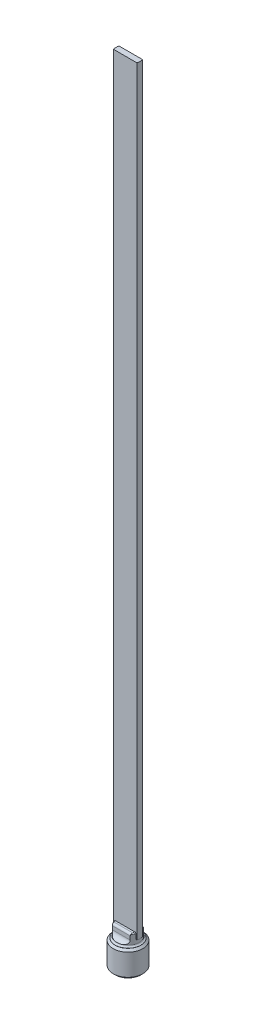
ISO-10303-21;
HEADER;
FILE_DESCRIPTION(('STEP AP214'),'2;1');
FILE_NAME('part.step','',(''),(''),'','','');
FILE_SCHEMA(('AUTOMOTIVE_DESIGN { 1 0 10303 214 1 1 1 1 }'));
ENDSEC;
DATA;
#1=APPLICATION_CONTEXT('core data for automotive mechanical design processes');
#2=APPLICATION_PROTOCOL_DEFINITION('international standard','automotive_design',2000,#1);
#3=PRODUCT_CONTEXT('',#1,'mechanical');
#4=PRODUCT('Part','Part','',(#3));
#5=PRODUCT_RELATED_PRODUCT_CATEGORY('part','',(#4));
#6=PRODUCT_DEFINITION_FORMATION('','',#4);
#7=PRODUCT_DEFINITION_CONTEXT('part definition',#1,'design');
#8=PRODUCT_DEFINITION('design','',#6,#7);
#9=PRODUCT_DEFINITION_SHAPE('','',#8);
#10=(LENGTH_UNIT() NAMED_UNIT(*) SI_UNIT(.MILLI.,.METRE.));
#11=(NAMED_UNIT(*) PLANE_ANGLE_UNIT() SI_UNIT($,.RADIAN.));
#12=(NAMED_UNIT(*) SI_UNIT($,.STERADIAN.) SOLID_ANGLE_UNIT());
#13=UNCERTAINTY_MEASURE_WITH_UNIT(LENGTH_MEASURE(1.E-05),#10,'distance_accuracy_value','');
#14=(GEOMETRIC_REPRESENTATION_CONTEXT(3) GLOBAL_UNCERTAINTY_ASSIGNED_CONTEXT((#13)) GLOBAL_UNIT_ASSIGNED_CONTEXT((#10,
#11,#12)) REPRESENTATION_CONTEXT('',''));
#15=CARTESIAN_POINT('',(0.,0.,0.));
#16=DIRECTION('',(0.,0.,1.));
#17=DIRECTION('',(1.,0.,0.));
#18=AXIS2_PLACEMENT_3D('',#15,#16,#17);
#19=CARTESIAN_POINT('',(0.,9.525,-2.8575));
#20=DIRECTION('',(0.,1.,0.));
#21=DIRECTION('',(0.,0.,1.));
#22=AXIS2_PLACEMENT_3D('',#19,#20,#21);
#23=PLANE('',#22);
#24=DIRECTION('',(1.,0.,0.));
#25=VECTOR('',#24,1.);
#26=CARTESIAN_POINT('',(0.,9.525,0.723899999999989));
#27=LINE('',#26,#25);
#28=CARTESIAN_POINT('',(2.50083606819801,9.525,0.723899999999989));
#29=VERTEX_POINT('',#28);
#30=CARTESIAN_POINT('',(-2.50083606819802,9.525,0.723899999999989));
#31=VERTEX_POINT('',#30);
#32=EDGE_CURVE('E170',#29,#31,#27,.F.);
#33=ORIENTED_EDGE('',*,*,#32,.T.);
#34=CARTESIAN_POINT('',(0.,9.52499999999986,0.));
#35=DIRECTION('',(0.,-1.,0.));
#36=DIRECTION('',(1.,0.,0.));
#37=AXIS2_PLACEMENT_3D('',#34,#35,#36);
#38=CIRCLE('',#37,2.60350000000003);
#39=CARTESIAN_POINT('',(-2.30706956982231,9.52499999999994,1.2065));
#40=VERTEX_POINT('',#39);
#41=EDGE_CURVE('E176',#31,#40,#38,.F.);
#42=ORIENTED_EDGE('',*,*,#41,.T.);
#43=DIRECTION('',(1.,0.,0.));
#44=VECTOR('',#43,1.);
#45=CARTESIAN_POINT('',(0.,9.525,1.2065));
#46=LINE('',#45,#44);
#47=CARTESIAN_POINT('',(2.30706956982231,9.525,1.2065));
#48=VERTEX_POINT('',#47);
#49=EDGE_CURVE('E174',#48,#40,#46,.F.);
#50=ORIENTED_EDGE('',*,*,#49,.F.);
#51=CARTESIAN_POINT('',(0.,9.525,0.));
#52=DIRECTION('',(0.,-1.,0.));
#53=DIRECTION('',(0.,0.,-1.));
#54=AXIS2_PLACEMENT_3D('',#51,#52,#53);
#55=CIRCLE('',#54,2.6035);
#56=EDGE_CURVE('E158',#48,#29,#55,.F.);
#57=ORIENTED_EDGE('',*,*,#56,.T.);
#58=EDGE_LOOP('',(#33,#42,#50,#57));
#59=FACE_BOUND('',#58,.T.);
#60=ADVANCED_FACE('F35',(#59),#23,.T.);
#61=CARTESIAN_POINT('',(0.,9.525,-2.8575));
#62=DIRECTION('',(0.,1.,0.));
#63=DIRECTION('',(0.,0.,1.));
#64=AXIS2_PLACEMENT_3D('',#61,#62,#63);
#65=PLANE('',#64);
#66=DIRECTION('',(1.,0.,0.));
#67=VECTOR('',#66,1.);
#68=CARTESIAN_POINT('',(0.,9.525,-0.7239));
#69=LINE('',#68,#67);
#70=CARTESIAN_POINT('',(-2.50083606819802,9.525,-0.7239));
#71=VERTEX_POINT('',#70);
#72=CARTESIAN_POINT('',(2.50083606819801,9.525,-0.723900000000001));
#73=VERTEX_POINT('',#72);
#74=EDGE_CURVE('E421',#71,#73,#69,.T.);
#75=ORIENTED_EDGE('',*,*,#74,.T.);
#76=CARTESIAN_POINT('',(0.,9.52499999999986,0.));
#77=DIRECTION('',(0.,-1.,0.));
#78=DIRECTION('',(1.,0.,0.));
#79=AXIS2_PLACEMENT_3D('',#76,#77,#78);
#80=CIRCLE('',#79,2.60350000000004);
#81=CARTESIAN_POINT('',(2.30706956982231,9.52499999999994,-1.2065));
#82=VERTEX_POINT('',#81);
#83=EDGE_CURVE('E188',#73,#82,#80,.F.);
#84=ORIENTED_EDGE('',*,*,#83,.T.);
#85=DIRECTION('',(-1.,0.,0.));
#86=VECTOR('',#85,1.);
#87=CARTESIAN_POINT('',(0.,9.525,-1.2065));
#88=LINE('',#87,#86);
#89=CARTESIAN_POINT('',(-2.30706956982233,9.52499999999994,-1.2065));
#90=VERTEX_POINT('',#89);
#91=EDGE_CURVE('E415',#90,#82,#88,.F.);
#92=ORIENTED_EDGE('',*,*,#91,.F.);
#93=CARTESIAN_POINT('',(0.,9.52499999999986,0.));
#94=DIRECTION('',(0.,-1.,0.));
#95=DIRECTION('',(1.,0.,0.));
#96=AXIS2_PLACEMENT_3D('',#93,#94,#95);
#97=CIRCLE('',#96,2.60350000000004);
#98=EDGE_CURVE('E424',#90,#71,#97,.F.);
#99=ORIENTED_EDGE('',*,*,#98,.T.);
#100=EDGE_LOOP('',(#75,#84,#92,#99));
#101=FACE_BOUND('',#100,.T.);
#102=ADVANCED_FACE('F785',(#101),#65,.T.);
#103=CARTESIAN_POINT('',(0.,9.017,1.2065));
#104=DIRECTION('',(1.,0.,0.));
#105=DIRECTION('',(0.,0.,-1.));
#106=AXIS2_PLACEMENT_3D('',#103,#104,#105);
#107=CYLINDRICAL_SURFACE('',#106,0.508);
#108=CARTESIAN_POINT('',(-2.33549536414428,9.27100000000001,1.64644090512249));
#109=CARTESIAN_POINT('',(-2.32711430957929,9.25045802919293,1.65832633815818));
#110=CARTESIAN_POINT('',(-2.31952240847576,9.22876240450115,1.66890508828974));
#111=CARTESIAN_POINT('',(-2.30654707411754,9.18415445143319,1.6867924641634));
#112=CARTESIAN_POINT('',(-2.30111175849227,9.16128790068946,1.69417835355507));
#113=CARTESIAN_POINT('',(-2.29335388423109,9.11846499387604,1.7046613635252));
#114=CARTESIAN_POINT('',(-2.29065110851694,9.09870792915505,1.70828555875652));
#115=CARTESIAN_POINT('',(-2.28694587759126,9.05831449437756,1.71323903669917));
#116=CARTESIAN_POINT('',(-2.28598165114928,9.03766834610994,1.71451673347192));
#117=CARTESIAN_POINT('',(-2.286,9.017,1.7145));
#118=B_SPLINE_CURVE_WITH_KNOTS('',3,(#108,#109,#110,#111,#112,#113,#114,#115,#116,#117),
.UNSPECIFIED.,.F.,.F.,(4,2,2,2,4),(0.,0.0755339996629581,0.149120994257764,0.209711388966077,
0.271618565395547),.UNSPECIFIED.);
#119=CARTESIAN_POINT('',(-2.33549536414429,9.271,1.64644090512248));
#120=VERTEX_POINT('',#119);
#121=CARTESIAN_POINT('',(-2.28600000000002,9.017,1.7145));
#122=VERTEX_POINT('',#121);
#123=EDGE_CURVE('E616',#120,#122,#118,.T.);
#124=ORIENTED_EDGE('',*,*,#123,.T.);
#125=DIRECTION('',(-1.,0.,0.));
#126=VECTOR('',#125,1.);
#127=CARTESIAN_POINT('',(0.,9.017,1.7145));
#128=LINE('',#127,#126);
#129=CARTESIAN_POINT('',(2.28600000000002,9.017,1.7145));
#130=VERTEX_POINT('',#129);
#131=EDGE_CURVE('E410',#122,#130,#128,.F.);
#132=ORIENTED_EDGE('',*,*,#131,.T.);
#133=CARTESIAN_POINT('',(2.286,9.017,1.7145));
#134=CARTESIAN_POINT('',(2.28595922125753,9.04216276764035,1.71453821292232));
#135=CARTESIAN_POINT('',(2.28740065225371,9.06727897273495,1.71263305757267));
#136=CARTESIAN_POINT('',(2.29285493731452,9.11606219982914,1.70533169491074));
#137=CARTESIAN_POINT('',(2.2968018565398,9.13974980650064,1.700024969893));
#138=CARTESIAN_POINT('',(2.30603841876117,9.18172259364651,1.68746527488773));
#139=CARTESIAN_POINT('',(2.31098117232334,9.20023705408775,1.68070290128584));
#140=CARTESIAN_POINT('',(2.3222533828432,9.2364346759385,1.6650948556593));
#141=CARTESIAN_POINT('',(2.32861034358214,9.25409144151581,1.6562075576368));
#142=CARTESIAN_POINT('',(2.33549536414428,9.27100000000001,1.64644090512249));
#143=B_SPLINE_CURVE_WITH_KNOTS('',3,(#133,#134,#135,#136,#137,#138,#139,#140,#141,#142),
.UNSPECIFIED.,.F.,.F.,(4,2,2,2,4),(0.,0.0753042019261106,0.148704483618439,0.209502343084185,
0.271606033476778),.UNSPECIFIED.);
#144=CARTESIAN_POINT('',(2.33549536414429,9.271,1.64644090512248));
#145=VERTEX_POINT('',#144);
#146=EDGE_CURVE('E186',#130,#145,#143,.T.);
#147=ORIENTED_EDGE('',*,*,#146,.T.);
#148=CARTESIAN_POINT('',(2.33549536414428,9.27100000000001,1.64644090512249));
#149=CARTESIAN_POINT('',(2.34271171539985,9.28872841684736,1.6362522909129));
#150=CARTESIAN_POINT('',(2.34846430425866,9.30620849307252,1.6246899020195));
#151=CARTESIAN_POINT('',(2.35733797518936,9.33993546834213,1.59919596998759));
#152=CARTESIAN_POINT('',(2.3604724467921,9.35618825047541,1.5852769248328));
#153=CARTESIAN_POINT('',(2.3644231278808,9.38653250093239,1.55571415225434));
#154=CARTESIAN_POINT('',(2.36529579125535,9.40066812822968,1.54012275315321));
#155=CARTESIAN_POINT('',(2.36522400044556,9.42690473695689,1.5073046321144));
#156=CARTESIAN_POINT('',(2.36427779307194,9.43900374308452,1.49007634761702));
#157=CARTESIAN_POINT('',(2.36070515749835,9.46212399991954,1.45240529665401));
#158=CARTESIAN_POINT('',(2.35790567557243,9.4728811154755,1.4318172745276));
#159=CARTESIAN_POINT('',(2.35088205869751,9.49142830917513,1.38957025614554));
#160=CARTESIAN_POINT('',(2.34665687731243,9.4992161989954,1.36791048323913));
#161=CARTESIAN_POINT('',(2.33713790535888,9.51179318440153,1.3238522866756));
#162=CARTESIAN_POINT('',(2.33183884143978,9.51656698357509,1.30145069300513));
#163=CARTESIAN_POINT('',(2.32054087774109,9.52305190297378,1.2564170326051));
#164=CARTESIAN_POINT('',(2.31454321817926,9.52476836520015,1.23378543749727));
#165=CARTESIAN_POINT('',(2.30793337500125,9.52499271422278,1.20964442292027));
#166=CARTESIAN_POINT('',(2.30750188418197,9.5250000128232,1.20807202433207));
#167=CARTESIAN_POINT('',(2.30706956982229,9.525,1.2065));
#168=B_SPLINE_CURVE_WITH_KNOTS('',3,(#148,#149,#150,#151,#152,#153,#154,#155,#156,#157,#158,
#159,#160,#161,#162,#163,#164,#165,#166,#167),.UNSPECIFIED.,.F.,.F.,(4,2,2,2,2,2,2,2,2,4),(0.,
0.0648980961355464,0.129462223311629,0.192398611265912,0.255395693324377,0.325308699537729,
0.39527313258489,0.46558983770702,0.535783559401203,0.540675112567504),.UNSPECIFIED.);
#169=EDGE_CURVE('E163',#145,#48,#168,.T.);
#170=ORIENTED_EDGE('',*,*,#169,.T.);
#171=ORIENTED_EDGE('',*,*,#49,.T.);
#172=CARTESIAN_POINT('',(-2.30706956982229,9.525,1.2065));
#173=CARTESIAN_POINT('',(-2.30750187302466,9.52500002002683,1.20807198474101));
#174=CARTESIAN_POINT('',(-2.30793336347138,9.5249927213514,1.20964438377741));
#175=CARTESIAN_POINT('',(-2.31614793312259,9.52471377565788,1.2396463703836));
#176=CARTESIAN_POINT('',(-2.32364715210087,9.5220563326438,1.26818878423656));
#177=CARTESIAN_POINT('',(-2.33740246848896,9.51187793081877,1.32477643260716));
#178=CARTESIAN_POINT('',(-2.34365503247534,9.50434339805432,1.35282005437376));
#179=CARTESIAN_POINT('',(-2.35411609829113,9.48453553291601,1.40725680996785));
#180=CARTESIAN_POINT('',(-2.35834617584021,9.4723148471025,1.43366462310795));
#181=CARTESIAN_POINT('',(-2.3640562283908,9.44336954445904,1.48420035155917));
#182=CARTESIAN_POINT('',(-2.36554064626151,9.42665225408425,1.5083318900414));
#183=CARTESIAN_POINT('',(-2.36493592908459,9.39176005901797,1.55039836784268));
#184=CARTESIAN_POINT('',(-2.36328690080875,9.37405831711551,1.5687310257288));
#185=CARTESIAN_POINT('',(-2.35666477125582,9.33645164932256,1.60228630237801));
#186=CARTESIAN_POINT('',(-2.35169444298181,9.31654857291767,1.61751150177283));
#187=CARTESIAN_POINT('',(-2.33890128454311,9.27850848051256,1.64253146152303));
#188=CARTESIAN_POINT('',(-2.33156772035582,9.26050763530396,1.65278595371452));
#189=CARTESIAN_POINT('',(-2.31389025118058,9.22466632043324,1.67054260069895));
#190=CARTESIAN_POINT('',(-2.30355332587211,9.20682557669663,1.67805104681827));
#191=CARTESIAN_POINT('',(-2.28575370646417,9.18084470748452,1.68744522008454));
#192=CARTESIAN_POINT('',(-2.27939659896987,9.17226936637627,1.69027553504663));
#193=CARTESIAN_POINT('',(-2.27266278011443,9.1639114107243,1.69279315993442));
#194=B_SPLINE_CURVE_WITH_KNOTS('',3,(#172,#173,#174,#175,#176,#177,#178,#179,#180,#181,#182,
#183,#184,#185,#186,#187,#188,#189,#190,#191,#192,#193),.UNSPECIFIED.,.F.,.F.,(4,2,2,2,2,2,2,2,
2,2,4),(0.,0.00489155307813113,0.0933121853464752,0.181979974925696,0.269679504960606,
0.357237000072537,0.433394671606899,0.509488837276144,0.575064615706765,0.640489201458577,
0.673568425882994),.UNSPECIFIED.);
#195=EDGE_CURVE('E180',#40,#120,#194,.T.);
#196=ORIENTED_EDGE('',*,*,#195,.T.);
#197=EDGE_LOOP('',(#124,#132,#147,#170,#171,#196));
#198=FACE_BOUND('',#197,.T.);
#199=ADVANCED_FACE('F184',(#198),#107,.T.);
#200=CARTESIAN_POINT('',(0.,9.017,-1.2065));
#201=DIRECTION('',(-1.,0.,0.));
#202=DIRECTION('',(0.,0.,1.));
#203=AXIS2_PLACEMENT_3D('',#200,#201,#202);
#204=CYLINDRICAL_SURFACE('',#203,0.508);
#205=CARTESIAN_POINT('',(2.33549536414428,9.27100000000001,-1.64644090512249));
#206=CARTESIAN_POINT('',(2.32711430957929,9.25045802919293,-1.65832633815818));
#207=CARTESIAN_POINT('',(2.31952240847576,9.22876240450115,-1.66890508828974));
#208=CARTESIAN_POINT('',(2.30654707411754,9.18415445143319,-1.6867924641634));
#209=CARTESIAN_POINT('',(2.30111175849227,9.16128790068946,-1.69417835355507));
#210=CARTESIAN_POINT('',(2.29335388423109,9.11846499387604,-1.7046613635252));
#211=CARTESIAN_POINT('',(2.29065110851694,9.09870792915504,-1.70828555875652));
#212=CARTESIAN_POINT('',(2.28694587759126,9.05831449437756,-1.71323903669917));
#213=CARTESIAN_POINT('',(2.28598165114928,9.03766834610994,-1.71451673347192));
#214=CARTESIAN_POINT('',(2.286,9.017,-1.7145));
#215=B_SPLINE_CURVE_WITH_KNOTS('',3,(#205,#206,#207,#208,#209,#210,#211,#212,#213,#214),
.UNSPECIFIED.,.F.,.F.,(4,2,2,2,4),(0.,0.0755339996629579,0.149120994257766,0.209711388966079,
0.271618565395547),.UNSPECIFIED.);
#216=CARTESIAN_POINT('',(2.33549536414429,9.271,-1.64644090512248));
#217=VERTEX_POINT('',#216);
#218=CARTESIAN_POINT('',(2.28600000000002,9.017,-1.7145));
#219=VERTEX_POINT('',#218);
#220=EDGE_CURVE('E411',#217,#219,#215,.T.);
#221=ORIENTED_EDGE('',*,*,#220,.T.);
#222=DIRECTION('',(1.,0.,0.));
#223=VECTOR('',#222,1.);
#224=CARTESIAN_POINT('',(0.,9.017,-1.7145));
#225=LINE('',#224,#223);
#226=CARTESIAN_POINT('',(-2.28600000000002,9.017,-1.7145));
#227=VERTEX_POINT('',#226);
#228=EDGE_CURVE('E405',#219,#227,#225,.F.);
#229=ORIENTED_EDGE('',*,*,#228,.T.);
#230=CARTESIAN_POINT('',(-2.286,9.017,-1.7145));
#231=CARTESIAN_POINT('',(-2.28595922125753,9.04216276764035,-1.71453821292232));
#232=CARTESIAN_POINT('',(-2.28740065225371,9.06727897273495,-1.71263305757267));
#233=CARTESIAN_POINT('',(-2.29285493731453,9.11606219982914,-1.70533169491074));
#234=CARTESIAN_POINT('',(-2.2968018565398,9.13974980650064,-1.700024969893));
#235=CARTESIAN_POINT('',(-2.30603841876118,9.18172259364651,-1.68746527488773));
#236=CARTESIAN_POINT('',(-2.31098117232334,9.20023705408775,-1.68070290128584));
#237=CARTESIAN_POINT('',(-2.3222533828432,9.2364346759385,-1.6650948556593));
#238=CARTESIAN_POINT('',(-2.32861034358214,9.25409144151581,-1.6562075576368));
#239=CARTESIAN_POINT('',(-2.33549536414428,9.27100000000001,-1.64644090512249));
#240=B_SPLINE_CURVE_WITH_KNOTS('',3,(#230,#231,#232,#233,#234,#235,#236,#237,#238,#239),
.UNSPECIFIED.,.F.,.F.,(4,2,2,2,4),(0.,0.0753042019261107,0.148704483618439,0.209502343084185,
0.27160603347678),.UNSPECIFIED.);
#241=CARTESIAN_POINT('',(-2.33549536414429,9.27100000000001,-1.64644090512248));
#242=VERTEX_POINT('',#241);
#243=EDGE_CURVE('E610',#227,#242,#240,.T.);
#244=ORIENTED_EDGE('',*,*,#243,.T.);
#245=CARTESIAN_POINT('',(-2.33549536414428,9.27100000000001,-1.64644090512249));
#246=CARTESIAN_POINT('',(-2.34271171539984,9.28872841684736,-1.6362522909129));
#247=CARTESIAN_POINT('',(-2.34846430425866,9.30620849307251,-1.62468990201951));
#248=CARTESIAN_POINT('',(-2.35733797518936,9.33993546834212,-1.5991959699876));
#249=CARTESIAN_POINT('',(-2.3604724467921,9.3561882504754,-1.5852769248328));
#250=CARTESIAN_POINT('',(-2.3644231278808,9.38653250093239,-1.55571415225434));
#251=CARTESIAN_POINT('',(-2.36529579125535,9.40066812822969,-1.5401227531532));
#252=CARTESIAN_POINT('',(-2.36522400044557,9.4269047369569,-1.50730463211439));
#253=CARTESIAN_POINT('',(-2.36427779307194,9.43900374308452,-1.49007634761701));
#254=CARTESIAN_POINT('',(-2.36070515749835,9.46212399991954,-1.45240529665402));
#255=CARTESIAN_POINT('',(-2.35790567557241,9.47288111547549,-1.43181727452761));
#256=CARTESIAN_POINT('',(-2.35088205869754,9.49142830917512,-1.38957025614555));
#257=CARTESIAN_POINT('',(-2.34665687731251,9.4992161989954,-1.36791048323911));
#258=CARTESIAN_POINT('',(-2.33713790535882,9.51179318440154,-1.3238522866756));
#259=CARTESIAN_POINT('',(-2.33183884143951,9.51656698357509,-1.30145069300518));
#260=CARTESIAN_POINT('',(-2.32054087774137,9.52305190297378,-1.256417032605));
#261=CARTESIAN_POINT('',(-2.3145432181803,9.52476836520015,-1.23378543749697));
#262=CARTESIAN_POINT('',(-2.3079333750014,9.52499271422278,-1.20964442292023));
#263=CARTESIAN_POINT('',(-2.30750188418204,9.52500001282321,-1.20807202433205));
#264=CARTESIAN_POINT('',(-2.30706956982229,9.525,-1.2065));
#265=B_SPLINE_CURVE_WITH_KNOTS('',3,(#245,#246,#247,#248,#249,#250,#251,#252,#253,#254,#255,
#256,#257,#258,#259,#260,#261,#262,#263,#264),.UNSPECIFIED.,.F.,.F.,(4,2,2,2,2,2,2,2,2,4),(0.,
0.0648980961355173,0.12946222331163,0.192398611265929,0.255395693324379,0.325308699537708,
0.395273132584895,0.465589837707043,0.535783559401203,0.540675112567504),.UNSPECIFIED.);
#266=EDGE_CURVE('E419',#242,#90,#265,.T.);
#267=ORIENTED_EDGE('',*,*,#266,.T.);
#268=ORIENTED_EDGE('',*,*,#91,.T.);
#269=CARTESIAN_POINT('',(2.30706956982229,9.525,-1.2065));
#270=CARTESIAN_POINT('',(2.30750187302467,9.52500002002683,-1.20807198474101));
#271=CARTESIAN_POINT('',(2.30793336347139,9.5249927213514,-1.2096443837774));
#272=CARTESIAN_POINT('',(2.31614793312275,9.52471377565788,-1.23964637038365));
#273=CARTESIAN_POINT('',(2.32364715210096,9.52205633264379,-1.26818878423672));
#274=CARTESIAN_POINT('',(2.337402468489,9.51187793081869,-1.32477643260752));
#275=CARTESIAN_POINT('',(2.34365503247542,9.5043433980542,-1.3528200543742));
#276=CARTESIAN_POINT('',(2.35411609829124,9.48453553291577,-1.40725680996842));
#277=CARTESIAN_POINT('',(2.35834617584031,9.4723148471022,-1.43366462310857));
#278=CARTESIAN_POINT('',(2.36405622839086,9.44336954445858,-1.48420035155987));
#279=CARTESIAN_POINT('',(2.36554064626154,9.42665225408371,-1.50833189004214));
#280=CARTESIAN_POINT('',(2.36493592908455,9.39176005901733,-1.55039836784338));
#281=CARTESIAN_POINT('',(2.36328690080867,9.37405831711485,-1.56873102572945));
#282=CARTESIAN_POINT('',(2.35666477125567,9.33645164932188,-1.60228630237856));
#283=CARTESIAN_POINT('',(2.35169444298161,9.31654857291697,-1.61751150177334));
#284=CARTESIAN_POINT('',(2.33890128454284,9.27850848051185,-1.64253146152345));
#285=CARTESIAN_POINT('',(2.33156772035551,9.26050763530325,-1.65278595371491));
#286=CARTESIAN_POINT('',(2.3138902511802,9.22466632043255,-1.67054260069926));
#287=CARTESIAN_POINT('',(2.30355332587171,9.20682557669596,-1.67805104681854));
#288=CARTESIAN_POINT('',(2.28575370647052,9.18084470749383,-1.68744522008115));
#289=CARTESIAN_POINT('',(2.27939659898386,9.17226936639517,-1.69027553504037));
#290=CARTESIAN_POINT('',(2.27266278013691,9.16391141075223,-1.69279315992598));
#291=B_SPLINE_CURVE_WITH_KNOTS('',3,(#269,#270,#271,#272,#273,#274,#275,#276,#277,#278,#279,
#280,#281,#282,#283,#284,#285,#286,#287,#288,#289,#290),.UNSPECIFIED.,.F.,.F.,(4,2,2,2,2,2,2,2,
2,2,4),(0.,0.00489155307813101,0.0933121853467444,0.181979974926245,0.269679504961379,
0.357237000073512,0.433394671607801,0.509488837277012,0.575064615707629,0.640489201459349,
0.673568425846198),.UNSPECIFIED.);
#292=EDGE_CURVE('E418',#82,#217,#291,.T.);
#293=ORIENTED_EDGE('',*,*,#292,.T.);
#294=EDGE_LOOP('',(#221,#229,#244,#267,#268,#293));
#295=FACE_BOUND('',#294,.T.);
#296=ADVANCED_FACE('F595',(#295),#204,.T.);
#297=CARTESIAN_POINT('',(0.,6.985,1.7145));
#298=DIRECTION('',(0.,0.,-1.));
#299=DIRECTION('',(-1.,0.,0.));
#300=AXIS2_PLACEMENT_3D('',#297,#298,#299);
#301=PLANE('',#300);
#302=ORIENTED_EDGE('',*,*,#131,.F.);
#303=DIRECTION('',(0.,1.,0.));
#304=VECTOR('',#303,1.);
#305=CARTESIAN_POINT('',(-2.28600000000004,6.985,1.7145));
#306=LINE('',#305,#304);
#307=CARTESIAN_POINT('',(-2.28600000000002,8.1026,1.7145));
#308=VERTEX_POINT('',#307);
#309=EDGE_CURVE('E408',#308,#122,#306,.T.);
#310=ORIENTED_EDGE('',*,*,#309,.F.);
#311=DIRECTION('',(1.,0.,0.));
#312=VECTOR('',#311,1.);
#313=CARTESIAN_POINT('',(0.,8.1026,1.7145));
#314=LINE('',#313,#312);
#315=CARTESIAN_POINT('',(2.28600000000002,8.1026,1.7145));
#316=VERTEX_POINT('',#315);
#317=EDGE_CURVE('E374',#308,#316,#314,.T.);
#318=ORIENTED_EDGE('',*,*,#317,.T.);
#319=DIRECTION('',(0.,1.,0.));
#320=VECTOR('',#319,1.);
#321=CARTESIAN_POINT('',(2.28600000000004,6.985,1.7145));
#322=LINE('',#321,#320);
#323=EDGE_CURVE('E406',#130,#316,#322,.F.);
#324=ORIENTED_EDGE('',*,*,#323,.F.);
#325=EDGE_LOOP('',(#302,#310,#318,#324));
#326=FACE_BOUND('',#325,.T.);
#327=ADVANCED_FACE('F599',(#326),#301,.F.);
#328=CARTESIAN_POINT('',(0.,9.525,-1.7145));
#329=DIRECTION('',(0.,0.,1.));
#330=DIRECTION('',(1.,0.,0.));
#331=AXIS2_PLACEMENT_3D('',#328,#329,#330);
#332=PLANE('',#331);
#333=ORIENTED_EDGE('',*,*,#228,.F.);
#334=DIRECTION('',(0.,1.,0.));
#335=VECTOR('',#334,1.);
#336=CARTESIAN_POINT('',(2.28600000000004,9.525,-1.7145));
#337=LINE('',#336,#335);
#338=CARTESIAN_POINT('',(2.28600000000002,8.1026,-1.7145));
#339=VERTEX_POINT('',#338);
#340=EDGE_CURVE('E403',#339,#219,#337,.T.);
#341=ORIENTED_EDGE('',*,*,#340,.F.);
#342=DIRECTION('',(1.,0.,0.));
#343=VECTOR('',#342,1.);
#344=CARTESIAN_POINT('',(0.,8.1026,-1.7145));
#345=LINE('',#344,#343);
#346=CARTESIAN_POINT('',(-2.28600000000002,8.1026,-1.7145));
#347=VERTEX_POINT('',#346);
#348=EDGE_CURVE('E367',#339,#347,#345,.F.);
#349=ORIENTED_EDGE('',*,*,#348,.T.);
#350=DIRECTION('',(0.,1.,0.));
#351=VECTOR('',#350,1.);
#352=CARTESIAN_POINT('',(-2.28600000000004,9.525,-1.7145));
#353=LINE('',#352,#351);
#354=EDGE_CURVE('E377',#227,#347,#353,.F.);
#355=ORIENTED_EDGE('',*,*,#354,.F.);
#356=EDGE_LOOP('',(#333,#341,#349,#355));
#357=FACE_BOUND('',#356,.T.);
#358=ADVANCED_FACE('F251',(#357),#332,.F.);
#359=CARTESIAN_POINT('',(0.,5.4102,0.));
#360=DIRECTION('',(0.,-1.,0.));
#361=DIRECTION('',(0.,0.,-1.));
#362=AXIS2_PLACEMENT_3D('',#359,#360,#361);
#363=PLANE('',#362);
#364=DIRECTION('',(0.866025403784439,0.,0.5));
#365=VECTOR('',#364,1.);
#366=CARTESIAN_POINT('',(-1.9812,5.4102,1.14384635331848));
#367=LINE('',#366,#365);
#368=CARTESIAN_POINT('',(0.,5.4102,2.28769270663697));
#369=VERTEX_POINT('',#368);
#370=CARTESIAN_POINT('',(-1.9812,5.4102,1.14384635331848));
#371=VERTEX_POINT('',#370);
#372=EDGE_CURVE('E353',#369,#371,#367,.F.);
#373=ORIENTED_EDGE('',*,*,#372,.T.);
#374=DIRECTION('',(0.,0.,1.));
#375=VECTOR('',#374,1.);
#376=CARTESIAN_POINT('',(-1.9812,5.4102,-1.14384635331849));
#377=LINE('',#376,#375);
#378=CARTESIAN_POINT('',(-1.9812,5.4102,-1.14384635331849));
#379=VERTEX_POINT('',#378);
#380=EDGE_CURVE('E360',#371,#379,#377,.F.);
#381=ORIENTED_EDGE('',*,*,#380,.T.);
#382=DIRECTION('',(-0.866025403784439,0.,0.5));
#383=VECTOR('',#382,1.);
#384=CARTESIAN_POINT('',(0.,5.4102,-2.28769270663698));
#385=LINE('',#384,#383);
#386=CARTESIAN_POINT('',(0.,5.4102,-2.28769270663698));
#387=VERTEX_POINT('',#386);
#388=EDGE_CURVE('E363',#379,#387,#385,.F.);
#389=ORIENTED_EDGE('',*,*,#388,.T.);
#390=DIRECTION('',(-0.866025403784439,0.,-0.5));
#391=VECTOR('',#390,1.);
#392=CARTESIAN_POINT('',(1.9812,5.4102,-1.14384635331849));
#393=LINE('',#392,#391);
#394=CARTESIAN_POINT('',(1.9812,5.4102,-1.14384635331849));
#395=VERTEX_POINT('',#394);
#396=EDGE_CURVE('E380',#387,#395,#393,.F.);
#397=ORIENTED_EDGE('',*,*,#396,.T.);
#398=DIRECTION('',(0.,0.,-1.));
#399=VECTOR('',#398,1.);
#400=CARTESIAN_POINT('',(1.9812,5.4102,1.14384635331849));
#401=LINE('',#400,#399);
#402=CARTESIAN_POINT('',(1.9812,5.4102,1.14384635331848));
#403=VERTEX_POINT('',#402);
#404=EDGE_CURVE('E339',#395,#403,#401,.F.);
#405=ORIENTED_EDGE('',*,*,#404,.T.);
#406=DIRECTION('',(0.866025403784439,0.,-0.5));
#407=VECTOR('',#406,1.);
#408=CARTESIAN_POINT('',(0.,5.4102,2.28769270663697));
#409=LINE('',#408,#407);
#410=EDGE_CURVE('E346',#403,#369,#409,.F.);
#411=ORIENTED_EDGE('',*,*,#410,.T.);
#412=EDGE_LOOP('',(#373,#381,#389,#397,#405,#411));
#413=FACE_BOUND('',#412,.T.);
#414=ADVANCED_FACE('F243',(#413),#363,.T.);
#415=CARTESIAN_POINT('',(0.,9.27099999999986,0.));
#416=DIRECTION('',(0.,-1.,0.));
#417=DIRECTION('',(1.,0.,0.));
#418=AXIS2_PLACEMENT_3D('',#415,#416,#417);
#419=TOROIDAL_SURFACE('',#418,2.60349999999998,0.254000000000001);
#420=CARTESIAN_POINT('',(-2.50083606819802,9.525,0.723899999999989));
#421=CARTESIAN_POINT('',(-2.51609312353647,9.52501058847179,0.723899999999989));
#422=CARTESIAN_POINT('',(-2.5313516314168,9.52373209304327,0.723899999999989));
#423=CARTESIAN_POINT('',(-2.56145245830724,9.51865817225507,0.723899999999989));
#424=CARTESIAN_POINT('',(-2.57629454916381,9.51486139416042,0.723899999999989));
#425=CARTESIAN_POINT('',(-2.60514106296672,9.50480706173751,0.723899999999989));
#426=CARTESIAN_POINT('',(-2.61914460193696,9.49854696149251,0.723899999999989));
#427=CARTESIAN_POINT('',(-2.64586196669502,9.48371604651,0.723899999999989));
#428=CARTESIAN_POINT('',(-2.65857654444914,9.47514658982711,0.723899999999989));
#429=CARTESIAN_POINT('',(-2.68204857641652,9.45612693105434,0.723899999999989));
#430=CARTESIAN_POINT('',(-2.6928430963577,9.44572251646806,0.723899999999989));
#431=CARTESIAN_POINT('',(-2.71245697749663,9.42318671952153,0.723899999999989));
#432=CARTESIAN_POINT('',(-2.72127609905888,9.41105512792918,0.723899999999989));
#433=CARTESIAN_POINT('',(-2.73635645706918,9.3858730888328,0.723899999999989));
#434=CARTESIAN_POINT('',(-2.74269653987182,9.3728697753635,0.723899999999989));
#435=CARTESIAN_POINT('',(-2.75302461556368,9.3459671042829,0.723899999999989));
#436=CARTESIAN_POINT('',(-2.75701517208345,9.33206874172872,0.723899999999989));
#437=CARTESIAN_POINT('',(-2.76126680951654,9.3102065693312,0.723899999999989));
#438=CARTESIAN_POINT('',(-2.76239837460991,9.3024024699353,0.723899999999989));
#439=CARTESIAN_POINT('',(-2.76390741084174,9.28673354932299,0.723899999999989));
#440=CARTESIAN_POINT('',(-2.7642860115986,9.27886883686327,0.723899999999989));
#441=CARTESIAN_POINT('',(-2.76428562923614,9.27100000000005,0.723899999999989));
#442=B_SPLINE_CURVE_WITH_KNOTS('',3,(#420,#421,#422,#423,#424,#425,#426,#427,#428,#429,#430,
#431,#432,#433,#434,#435,#436,#437,#438,#439,#440,#441),.UNSPECIFIED.,.F.,.F.,(4,2,2,2,2,2,2,2,
2,2,4),(0.,0.0457204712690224,0.0914655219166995,0.137257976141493,0.183023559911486,
0.227776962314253,0.272535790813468,0.315725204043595,0.358867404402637,0.382492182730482,
0.40608149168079),.UNSPECIFIED.);
#443=CARTESIAN_POINT('',(-2.76428562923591,9.27100000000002,0.723899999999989));
#444=VERTEX_POINT('',#443);
#445=EDGE_CURVE('E228',#31,#444,#442,.T.);
#446=ORIENTED_EDGE('',*,*,#445,.T.);
#447=CARTESIAN_POINT('',(0.,9.271,0.));
#448=DIRECTION('',(0.,-1.,0.));
#449=DIRECTION('',(0.,0.,-1.));
#450=AXIS2_PLACEMENT_3D('',#447,#448,#449);
#451=CIRCLE('',#450,2.8575);
#452=EDGE_CURVE('E323',#120,#444,#451,.T.);
#453=ORIENTED_EDGE('',*,*,#452,.F.);
#454=ORIENTED_EDGE('',*,*,#195,.F.);
#455=ORIENTED_EDGE('',*,*,#41,.F.);
#456=EDGE_LOOP('',(#446,#453,#454,#455));
#457=FACE_BOUND('',#456,.T.);
#458=ADVANCED_FACE('F239',(#457),#419,.T.);
#459=CARTESIAN_POINT('',(0.,9.27099999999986,0.));
#460=DIRECTION('',(0.,-1.,0.));
#461=DIRECTION('',(1.,0.,0.));
#462=AXIS2_PLACEMENT_3D('',#459,#460,#461);
#463=TOROIDAL_SURFACE('',#462,2.60349999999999,0.253999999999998);
#464=CARTESIAN_POINT('',(-2.76428562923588,9.271,-0.7239));
#465=CARTESIAN_POINT('',(-2.76429951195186,9.28494381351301,-0.7239));
#466=CARTESIAN_POINT('',(-2.76309961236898,9.29888149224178,-0.7239));
#467=CARTESIAN_POINT('',(-2.75837767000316,9.32633505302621,-0.7239));
#468=CARTESIAN_POINT('',(-2.75485946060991,9.33985159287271,-0.7239));
#469=CARTESIAN_POINT('',(-2.74560482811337,9.36610434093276,-0.7239));
#470=CARTESIAN_POINT('',(-2.73986799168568,9.37884040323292,-0.7239));
#471=CARTESIAN_POINT('',(-2.7263656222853,9.40318597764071,-0.7239));
#472=CARTESIAN_POINT('',(-2.71859995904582,9.41479541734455,-0.7239));
#473=CARTESIAN_POINT('',(-2.70116404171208,9.43673366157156,-0.7239));
#474=CARTESIAN_POINT('',(-2.69147001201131,9.44704354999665,-0.7239));
#475=CARTESIAN_POINT('',(-2.67053428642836,9.46595014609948,-0.7239));
#476=CARTESIAN_POINT('',(-2.65929225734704,9.47454648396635,-0.7239));
#477=CARTESIAN_POINT('',(-2.63520948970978,9.49006948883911,-0.7239));
#478=CARTESIAN_POINT('',(-2.62232979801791,9.49693565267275,-0.7239));
#479=CARTESIAN_POINT('',(-2.59562749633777,9.50848901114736,-0.7239));
#480=CARTESIAN_POINT('',(-2.58180491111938,9.51317626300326,-0.7239));
#481=CARTESIAN_POINT('',(-2.55677523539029,9.51947996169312,-0.7239));
#482=CARTESIAN_POINT('',(-2.54567975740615,9.52155013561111,-0.7239));
#483=CARTESIAN_POINT('',(-2.52333560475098,9.52431016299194,-0.7239));
#484=CARTESIAN_POINT('',(-2.51208719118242,9.52500212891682,-0.7239));
#485=CARTESIAN_POINT('',(-2.50083606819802,9.525,-0.7239));
#486=B_SPLINE_CURVE_WITH_KNOTS('',3,(#464,#465,#466,#467,#468,#469,#470,#471,#472,#473,#474,
#475,#476,#477,#478,#479,#480,#481,#482,#483,#484,#485),.UNSPECIFIED.,.F.,.F.,(4,2,2,2,2,2,2,2,
2,2,4),(0.,0.0417706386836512,0.0834723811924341,0.125181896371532,0.166894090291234,
0.209156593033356,0.251428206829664,0.295019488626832,0.33860962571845,0.37238798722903,
0.406114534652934),.UNSPECIFIED.);
#487=CARTESIAN_POINT('',(-2.76428562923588,9.271,-0.723900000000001));
#488=VERTEX_POINT('',#487);
#489=EDGE_CURVE('E432',#488,#71,#486,.T.);
#490=ORIENTED_EDGE('',*,*,#489,.T.);
#491=ORIENTED_EDGE('',*,*,#98,.F.);
#492=ORIENTED_EDGE('',*,*,#266,.F.);
#493=CARTESIAN_POINT('',(0.,9.271,0.));
#494=DIRECTION('',(0.,-1.,0.));
#495=DIRECTION('',(0.,0.,-1.));
#496=AXIS2_PLACEMENT_3D('',#493,#494,#495);
#497=CIRCLE('',#496,2.8575);
#498=EDGE_CURVE('E319',#488,#242,#497,.T.);
#499=ORIENTED_EDGE('',*,*,#498,.F.);
#500=EDGE_LOOP('',(#490,#491,#492,#499));
#501=FACE_BOUND('',#500,.T.);
#502=ADVANCED_FACE('F216',(#501),#463,.T.);
#503=CARTESIAN_POINT('',(0.,9.271,0.));
#504=DIRECTION('',(0.,-1.,0.));
#505=DIRECTION('',(0.,0.,-1.));
#506=AXIS2_PLACEMENT_3D('',#503,#504,#505);
#507=TOROIDAL_SURFACE('',#506,2.6035,0.253999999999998);
#508=CARTESIAN_POINT('',(2.76428562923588,9.271,0.723899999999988));
#509=CARTESIAN_POINT('',(2.76429951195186,9.28494381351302,0.723899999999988));
#510=CARTESIAN_POINT('',(2.76309961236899,9.29888149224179,0.723899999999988));
#511=CARTESIAN_POINT('',(2.75837767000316,9.32633505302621,0.723899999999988));
#512=CARTESIAN_POINT('',(2.75485946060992,9.33985159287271,0.723899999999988));
#513=CARTESIAN_POINT('',(2.74560482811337,9.36610434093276,0.723899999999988));
#514=CARTESIAN_POINT('',(2.73986799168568,9.37884040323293,0.723899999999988));
#515=CARTESIAN_POINT('',(2.7263656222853,9.40318597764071,0.723899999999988));
#516=CARTESIAN_POINT('',(2.71859995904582,9.41479541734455,0.723899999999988));
#517=CARTESIAN_POINT('',(2.70116404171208,9.43673366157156,0.723899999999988));
#518=CARTESIAN_POINT('',(2.69147001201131,9.44704354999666,0.723899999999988));
#519=CARTESIAN_POINT('',(2.67053428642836,9.46595014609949,0.723899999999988));
#520=CARTESIAN_POINT('',(2.65929225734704,9.47454648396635,0.723899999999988));
#521=CARTESIAN_POINT('',(2.63520948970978,9.49006948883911,0.723899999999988));
#522=CARTESIAN_POINT('',(2.62232979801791,9.49693565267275,0.723899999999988));
#523=CARTESIAN_POINT('',(2.59562749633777,9.50848901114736,0.723899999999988));
#524=CARTESIAN_POINT('',(2.58180491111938,9.51317626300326,0.723899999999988));
#525=CARTESIAN_POINT('',(2.55677523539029,9.51947996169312,0.723899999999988));
#526=CARTESIAN_POINT('',(2.54567975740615,9.52155013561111,0.723899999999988));
#527=CARTESIAN_POINT('',(2.52333560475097,9.52431016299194,0.723899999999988));
#528=CARTESIAN_POINT('',(2.51208719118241,9.52500212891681,0.723899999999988));
#529=CARTESIAN_POINT('',(2.50083606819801,9.525,0.723899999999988));
#530=B_SPLINE_CURVE_WITH_KNOTS('',3,(#508,#509,#510,#511,#512,#513,#514,#515,#516,#517,#518,
#519,#520,#521,#522,#523,#524,#525,#526,#527,#528,#529),.UNSPECIFIED.,.F.,.F.,(4,2,2,2,2,2,2,2,
2,2,4),(0.,0.041770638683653,0.0834723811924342,0.125181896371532,0.166894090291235,
0.209156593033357,0.251428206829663,0.295019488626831,0.338609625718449,0.372387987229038,
0.406114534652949),.UNSPECIFIED.);
#531=CARTESIAN_POINT('',(2.76428562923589,9.271,0.723899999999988));
#532=VERTEX_POINT('',#531);
#533=EDGE_CURVE('E167',#532,#29,#530,.T.);
#534=ORIENTED_EDGE('',*,*,#533,.T.);
#535=ORIENTED_EDGE('',*,*,#56,.F.);
#536=ORIENTED_EDGE('',*,*,#169,.F.);
#537=CARTESIAN_POINT('',(0.,9.271,0.));
#538=DIRECTION('',(0.,-1.,0.));
#539=DIRECTION('',(0.,0.,-1.));
#540=AXIS2_PLACEMENT_3D('',#537,#538,#539);
#541=CIRCLE('',#540,2.8575);
#542=EDGE_CURVE('E312',#532,#145,#541,.T.);
#543=ORIENTED_EDGE('',*,*,#542,.F.);
#544=EDGE_LOOP('',(#534,#535,#536,#543));
#545=FACE_BOUND('',#544,.T.);
#546=ADVANCED_FACE('F160',(#545),#507,.T.);
#547=CARTESIAN_POINT('',(0.,8.1026,2.8321));
#548=DIRECTION('',(1.,0.,0.));
#549=DIRECTION('',(0.,0.,-1.));
#550=AXIS2_PLACEMENT_3D('',#547,#548,#549);
#551=CYLINDRICAL_SURFACE('',#550,1.1176);
#552=CARTESIAN_POINT('',(2.286,8.1026,1.7145));
#553=CARTESIAN_POINT('',(2.28599868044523,8.07660409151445,1.71449808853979));
#554=CARTESIAN_POINT('',(2.28531941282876,8.05062141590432,1.7154078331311));
#555=CARTESIAN_POINT('',(2.28260235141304,7.99885800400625,1.71902308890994));
#556=CARTESIAN_POINT('',(2.28056483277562,7.97307722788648,1.72172823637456));
#557=CARTESIAN_POINT('',(2.27243357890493,7.89650193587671,1.73246562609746));
#558=CARTESIAN_POINT('',(2.26432113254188,7.84625133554,1.74312032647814));
#559=CARTESIAN_POINT('',(2.24275895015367,7.74878062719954,1.77077411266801));
#560=CARTESIAN_POINT('',(2.22930990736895,7.70156012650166,1.78777237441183));
#561=CARTESIAN_POINT('',(2.19720687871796,7.611281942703,1.82708227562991));
#562=CARTESIAN_POINT('',(2.1785513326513,7.56822551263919,1.84939550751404));
#563=CARTESIAN_POINT('',(2.1357233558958,7.48602509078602,1.89870526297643));
#564=CARTESIAN_POINT('',(2.11141471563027,7.44701930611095,1.92581262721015));
#565=CARTESIAN_POINT('',(2.05801853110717,7.37472790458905,1.98277425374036));
#566=CARTESIAN_POINT('',(2.02892868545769,7.3414450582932,2.0126298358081));
#567=CARTESIAN_POINT('',(1.95390397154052,7.26834518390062,2.08597532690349));
#568=CARTESIAN_POINT('',(1.90590351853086,7.2312957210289,2.13011341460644));
#569=CARTESIAN_POINT('',(1.80310441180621,7.16737464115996,2.21781542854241));
#570=CARTESIAN_POINT('',(1.74829472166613,7.14051984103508,2.26137829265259));
#571=CARTESIAN_POINT('',(1.64963880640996,7.10164774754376,2.33380048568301));
#572=CARTESIAN_POINT('',(1.60706394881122,7.087581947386,2.36333975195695));
#573=CARTESIAN_POINT('',(1.51962443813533,7.06309365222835,2.42049184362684));
#574=CARTESIAN_POINT('',(1.47475874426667,7.0526728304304,2.44810377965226));
#575=CARTESIAN_POINT('',(1.33695914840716,7.02579476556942,2.52766434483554));
#576=CARTESIAN_POINT('',(1.24109966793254,7.01382009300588,2.57613266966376));
#577=CARTESIAN_POINT('',(1.08181395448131,7.00033647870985,2.64564274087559));
#578=CARTESIAN_POINT('',(1.01997669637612,6.99657733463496,2.67009103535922));
#579=CARTESIAN_POINT('',(0.894634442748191,6.99096072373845,2.71465493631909));
#580=CARTESIAN_POINT('',(0.831128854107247,6.98910394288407,2.73476897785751));
#581=CARTESIAN_POINT('',(0.703521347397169,6.98656590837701,2.77032631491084));
#582=CARTESIAN_POINT('',(0.639432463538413,6.98587265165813,2.78581592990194));
#583=CARTESIAN_POINT('',(0.510380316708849,6.98510378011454,2.81232265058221));
#584=CARTESIAN_POINT('',(0.445417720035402,6.98502771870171,2.82334298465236));
#585=CARTESIAN_POINT('',(0.380152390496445,6.985,2.83209999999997));
#586=B_SPLINE_CURVE_WITH_KNOTS('',3,(#552,#553,#554,#555,#556,#557,#558,#559,#560,#561,#562,
#563,#564,#565,#566,#567,#568,#569,#570,#571,#572,#573,#574,#575,#576,#577,#578,#579,#580,#581,
#582,#583,#584,#585),.UNSPECIFIED.,.F.,.F.,(4,2,2,2,2,2,2,2,2,2,2,2,2,2,2,2,4),(0.,
0.0779369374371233,0.155858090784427,0.311040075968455,0.466201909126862,0.621410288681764,
0.780838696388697,0.94034406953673,1.16409398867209,1.38821141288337,1.54907855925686,
1.71001945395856,2.03296347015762,2.23261987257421,2.43234824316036,2.63000323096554,
2.82751518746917),.UNSPECIFIED.);
#587=CARTESIAN_POINT('',(0.380152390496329,6.985,2.83209999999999));
#588=VERTEX_POINT('',#587);
#589=EDGE_CURVE('E314',#316,#588,#586,.T.);
#590=ORIENTED_EDGE('',*,*,#589,.F.);
#591=ORIENTED_EDGE('',*,*,#317,.F.);
#592=CARTESIAN_POINT('',(-0.380152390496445,6.985,2.83209999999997));
#593=CARTESIAN_POINT('',(-0.418967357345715,6.98500266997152,2.82688984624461));
#594=CARTESIAN_POINT('',(-0.45767080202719,6.9850361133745,2.82088225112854));
#595=CARTESIAN_POINT('',(-0.534799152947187,6.98525439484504,2.80728160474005));
#596=CARTESIAN_POINT('',(-0.573224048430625,6.98543923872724,2.79968849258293));
#597=CARTESIAN_POINT('',(-0.688117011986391,6.98635664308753,2.77451859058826));
#598=CARTESIAN_POINT('',(-0.764077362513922,6.98745265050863,2.75456815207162));
#599=CARTESIAN_POINT('',(-0.914906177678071,6.99163881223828,2.70823699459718));
#600=CARTESIAN_POINT('',(-0.989752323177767,6.99475155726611,2.6817855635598));
#601=CARTESIAN_POINT('',(-1.13673717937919,7.00435691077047,2.62286026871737));
#602=CARTESIAN_POINT('',(-1.20887866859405,7.01084594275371,2.59039280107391));
#603=CARTESIAN_POINT('',(-1.36173954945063,7.03042004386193,2.51385278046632));
#604=CARTESIAN_POINT('',(-1.44183398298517,7.04443844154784,2.46874573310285));
#605=CARTESIAN_POINT('',(-1.59535526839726,7.08261253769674,2.37240154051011));
#606=CARTESIAN_POINT('',(-1.66881004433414,7.10672312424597,2.32119239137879));
#607=CARTESIAN_POINT('',(-1.7911093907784,7.16147986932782,2.22749680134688));
#608=CARTESIAN_POINT('',(-1.8417255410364,7.18934162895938,2.18571795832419));
#609=CARTESIAN_POINT('',(-1.93650283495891,7.25462052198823,2.10219707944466));
#610=CARTESIAN_POINT('',(-1.98066962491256,7.29202921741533,2.06045504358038));
#611=CARTESIAN_POINT('',(-2.05370812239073,7.36925903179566,1.98739934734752));
#612=CARTESIAN_POINT('',(-2.08389781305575,7.407353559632,1.95558505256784));
#613=CARTESIAN_POINT('',(-2.13842050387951,7.49022968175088,1.8958111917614));
#614=CARTESIAN_POINT('',(-2.16275511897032,7.53500942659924,1.86785056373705));
#615=CARTESIAN_POINT('',(-2.20520009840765,7.63072917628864,1.8175520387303));
#616=CARTESIAN_POINT('',(-2.22327322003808,7.68170368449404,1.79524798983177));
#617=CARTESIAN_POINT('',(-2.25270472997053,7.78813372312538,1.75817942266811));
#618=CARTESIAN_POINT('',(-2.26406991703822,7.84358465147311,1.74340727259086));
#619=CARTESIAN_POINT('',(-2.27668887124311,7.93342266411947,1.72686169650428));
#620=CARTESIAN_POINT('',(-2.28018131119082,7.9670084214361,1.72223814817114));
#621=CARTESIAN_POINT('',(-2.28483466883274,8.03458887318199,1.71605417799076));
#622=CARTESIAN_POINT('',(-2.28599772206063,8.06858316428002,1.71449095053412));
#623=CARTESIAN_POINT('',(-2.286,8.1026,1.7145));
#624=B_SPLINE_CURVE_WITH_KNOTS('',3,(#592,#593,#594,#595,#596,#597,#598,#599,#600,#601,#602,
#603,#604,#605,#606,#607,#608,#609,#610,#611,#612,#613,#614,#615,#616,#617,#618,#619,#620,#621,
#622,#623),.UNSPECIFIED.,.F.,.F.,(4,2,2,2,2,2,2,2,2,2,2,2,2,2,2,4),(0.,0.117471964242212,
0.234948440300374,0.470281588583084,0.708297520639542,0.946061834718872,1.22422091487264,
1.50114968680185,1.71429427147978,1.92725111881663,2.10081120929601,2.27432337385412,
2.44885053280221,2.62320049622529,2.7252456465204,2.82719720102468),.UNSPECIFIED.);
#625=CARTESIAN_POINT('',(-0.380152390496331,6.985,2.83209999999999));
#626=VERTEX_POINT('',#625);
#627=EDGE_CURVE('E315',#626,#308,#624,.T.);
#628=ORIENTED_EDGE('',*,*,#627,.F.);
#629=DIRECTION('',(1.,0.,0.));
#630=VECTOR('',#629,1.);
#631=CARTESIAN_POINT('',(0.,6.985,2.8321));
#632=LINE('',#631,#630);
#633=EDGE_CURVE('E371',#588,#626,#632,.F.);
#634=ORIENTED_EDGE('',*,*,#633,.F.);
#635=EDGE_LOOP('',(#590,#591,#628,#634));
#636=FACE_BOUND('',#635,.T.);
#637=ADVANCED_FACE('F215',(#636),#551,.F.);
#638=CARTESIAN_POINT('',(0.,8.1026,-2.8321));
#639=DIRECTION('',(1.,0.,0.));
#640=DIRECTION('',(0.,0.,-1.));
#641=AXIS2_PLACEMENT_3D('',#638,#639,#640);
#642=CYLINDRICAL_SURFACE('',#641,1.1176);
#643=CARTESIAN_POINT('',(0.380152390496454,6.985,-2.83209999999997));
#644=CARTESIAN_POINT('',(0.418967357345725,6.98500266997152,-2.82688984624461));
#645=CARTESIAN_POINT('',(0.457670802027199,6.9850361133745,-2.82088225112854));
#646=CARTESIAN_POINT('',(0.534799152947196,6.98525439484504,-2.80728160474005));
#647=CARTESIAN_POINT('',(0.573224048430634,6.98543923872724,-2.79968849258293));
#648=CARTESIAN_POINT('',(0.6881170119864,6.98635664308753,-2.77451859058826));
#649=CARTESIAN_POINT('',(0.76407736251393,6.98745265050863,-2.75456815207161));
#650=CARTESIAN_POINT('',(0.91490617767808,6.99163881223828,-2.70823699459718));
#651=CARTESIAN_POINT('',(0.989752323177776,6.99475155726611,-2.6817855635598));
#652=CARTESIAN_POINT('',(1.1367371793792,7.00435691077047,-2.62286026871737));
#653=CARTESIAN_POINT('',(1.20887866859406,7.01084594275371,-2.59039280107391));
#654=CARTESIAN_POINT('',(1.36173954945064,7.03042004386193,-2.51385278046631));
#655=CARTESIAN_POINT('',(1.44183398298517,7.04443844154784,-2.46874573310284));
#656=CARTESIAN_POINT('',(1.59535526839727,7.08261253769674,-2.37240154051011));
#657=CARTESIAN_POINT('',(1.66881004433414,7.10672312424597,-2.32119239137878));
#658=CARTESIAN_POINT('',(1.79110939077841,7.16147986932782,-2.22749680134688));
#659=CARTESIAN_POINT('',(1.8417255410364,7.18934162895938,-2.18571795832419));
#660=CARTESIAN_POINT('',(1.93650283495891,7.25462052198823,-2.10219707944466));
#661=CARTESIAN_POINT('',(1.98066962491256,7.29202921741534,-2.06045504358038));
#662=CARTESIAN_POINT('',(2.05370812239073,7.36925903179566,-1.98739934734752));
#663=CARTESIAN_POINT('',(2.08389781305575,7.407353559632,-1.95558505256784));
#664=CARTESIAN_POINT('',(2.13842050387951,7.49022968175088,-1.89581119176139));
#665=CARTESIAN_POINT('',(2.16275511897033,7.53500942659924,-1.86785056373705));
#666=CARTESIAN_POINT('',(2.20520009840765,7.63072917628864,-1.8175520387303));
#667=CARTESIAN_POINT('',(2.22327322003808,7.68170368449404,-1.79524798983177));
#668=CARTESIAN_POINT('',(2.25270472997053,7.78813372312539,-1.7581794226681));
#669=CARTESIAN_POINT('',(2.26406991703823,7.84358465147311,-1.74340727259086));
#670=CARTESIAN_POINT('',(2.27668887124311,7.93342266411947,-1.72686169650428));
#671=CARTESIAN_POINT('',(2.28018131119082,7.9670084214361,-1.72223814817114));
#672=CARTESIAN_POINT('',(2.28483466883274,8.03458887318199,-1.71605417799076));
#673=CARTESIAN_POINT('',(2.28599772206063,8.06858316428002,-1.71449095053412));
#674=CARTESIAN_POINT('',(2.286,8.1026,-1.7145));
#675=B_SPLINE_CURVE_WITH_KNOTS('',3,(#643,#644,#645,#646,#647,#648,#649,#650,#651,#652,#653,
#654,#655,#656,#657,#658,#659,#660,#661,#662,#663,#664,#665,#666,#667,#668,#669,#670,#671,#672,
#673,#674),.UNSPECIFIED.,.F.,.F.,(4,2,2,2,2,2,2,2,2,2,2,2,2,2,2,4),(0.,0.117471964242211,
0.234948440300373,0.470281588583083,0.708297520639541,0.946061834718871,1.22422091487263,
1.50114968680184,1.71429427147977,1.92725111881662,2.100811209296,2.27432337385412,
2.44885053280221,2.62320049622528,2.72524564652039,2.82719720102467),.UNSPECIFIED.);
#676=CARTESIAN_POINT('',(0.380152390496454,6.985,-2.83209999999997));
#677=VERTEX_POINT('',#676);
#678=EDGE_CURVE('E311',#677,#339,#675,.T.);
#679=ORIENTED_EDGE('',*,*,#678,.F.);
#680=CARTESIAN_POINT('',(-0.380152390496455,6.985,-2.83209999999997));
#681=CARTESIAN_POINT('',(-0.317030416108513,6.98502398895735,-2.84057600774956));
#682=CARTESIAN_POINT('',(-0.253624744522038,6.98509642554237,-2.84693544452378));
#683=CARTESIAN_POINT('',(-0.126811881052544,6.98522874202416,-2.85538810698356));
#684=CARTESIAN_POINT('',(-0.0634059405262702,6.98528867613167,-2.8575001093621));
#685=CARTESIAN_POINT('',(0.0634059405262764,6.98528867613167,-2.8575001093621));
#686=CARTESIAN_POINT('',(0.126811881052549,6.98522874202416,-2.85538810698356));
#687=CARTESIAN_POINT('',(0.25362474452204,6.98509642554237,-2.84693544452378));
#688=CARTESIAN_POINT('',(0.317030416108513,6.98502398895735,-2.84057600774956));
#689=CARTESIAN_POINT('',(0.380152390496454,6.98499999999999,-2.83209999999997));
#690=B_SPLINE_CURVE_WITH_KNOTS('',3,(#680,#681,#682,#683,#684,#685,#686,#687,#688,#689),
.UNSPECIFIED.,.F.,.F.,(4,2,2,2,4),(0.,0.191029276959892,0.381212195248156,0.571395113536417,
0.762424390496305),.UNSPECIFIED.);
#691=CARTESIAN_POINT('',(-0.380152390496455,6.985,-2.83209999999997));
#692=VERTEX_POINT('',#691);
#693=EDGE_CURVE('E370',#692,#677,#690,.T.);
#694=ORIENTED_EDGE('',*,*,#693,.F.);
#695=CARTESIAN_POINT('',(-2.286,8.1026,-1.7145));
#696=CARTESIAN_POINT('',(-2.28599868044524,8.07660409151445,-1.71449808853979));
#697=CARTESIAN_POINT('',(-2.28531941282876,8.05062141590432,-1.7154078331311));
#698=CARTESIAN_POINT('',(-2.28260235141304,7.99885800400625,-1.71902308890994));
#699=CARTESIAN_POINT('',(-2.28056483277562,7.97307722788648,-1.72172823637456));
#700=CARTESIAN_POINT('',(-2.27243357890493,7.89650193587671,-1.73246562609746));
#701=CARTESIAN_POINT('',(-2.26432113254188,7.84625133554,-1.74312032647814));
#702=CARTESIAN_POINT('',(-2.24275895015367,7.74878062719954,-1.77077411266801));
#703=CARTESIAN_POINT('',(-2.22930990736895,7.70156012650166,-1.78777237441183));
#704=CARTESIAN_POINT('',(-2.19720687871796,7.611281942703,-1.82708227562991));
#705=CARTESIAN_POINT('',(-2.1785513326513,7.56822551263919,-1.84939550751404));
#706=CARTESIAN_POINT('',(-2.13572335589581,7.48602509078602,-1.89870526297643));
#707=CARTESIAN_POINT('',(-2.11141471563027,7.44701930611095,-1.92581262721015));
#708=CARTESIAN_POINT('',(-2.05801853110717,7.37472790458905,-1.98277425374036));
#709=CARTESIAN_POINT('',(-2.02892868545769,7.3414450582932,-2.0126298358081));
#710=CARTESIAN_POINT('',(-1.95390397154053,7.26834518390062,-2.08597532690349));
#711=CARTESIAN_POINT('',(-1.90590351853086,7.2312957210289,-2.13011341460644));
#712=CARTESIAN_POINT('',(-1.80310441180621,7.16737464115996,-2.2178154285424));
#713=CARTESIAN_POINT('',(-1.74829472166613,7.14051984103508,-2.26137829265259));
#714=CARTESIAN_POINT('',(-1.64963880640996,7.10164774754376,-2.33380048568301));
#715=CARTESIAN_POINT('',(-1.60706394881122,7.087581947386,-2.36333975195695));
#716=CARTESIAN_POINT('',(-1.51962443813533,7.06309365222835,-2.42049184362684));
#717=CARTESIAN_POINT('',(-1.47475874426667,7.0526728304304,-2.44810377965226));
#718=CARTESIAN_POINT('',(-1.33695914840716,7.02579476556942,-2.52766434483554));
#719=CARTESIAN_POINT('',(-1.24109966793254,7.01382009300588,-2.57613266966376));
#720=CARTESIAN_POINT('',(-1.08181395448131,7.00033647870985,-2.64564274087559));
#721=CARTESIAN_POINT('',(-1.01997669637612,6.99657733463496,-2.67009103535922));
#722=CARTESIAN_POINT('',(-0.894634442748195,6.99096072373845,-2.71465493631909));
#723=CARTESIAN_POINT('',(-0.831128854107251,6.98910394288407,-2.73476897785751));
#724=CARTESIAN_POINT('',(-0.703521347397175,6.98656590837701,-2.77032631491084));
#725=CARTESIAN_POINT('',(-0.639432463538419,6.98587265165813,-2.78581592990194));
#726=CARTESIAN_POINT('',(-0.510380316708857,6.98510378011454,-2.81232265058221));
#727=CARTESIAN_POINT('',(-0.445417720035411,6.98502771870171,-2.82334298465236));
#728=CARTESIAN_POINT('',(-0.380152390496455,6.985,-2.83209999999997));
#729=B_SPLINE_CURVE_WITH_KNOTS('',3,(#695,#696,#697,#698,#699,#700,#701,#702,#703,#704,#705,
#706,#707,#708,#709,#710,#711,#712,#713,#714,#715,#716,#717,#718,#719,#720,#721,#722,#723,#724,
#725,#726,#727,#728),.UNSPECIFIED.,.F.,.F.,(4,2,2,2,2,2,2,2,2,2,2,2,2,2,2,2,4),(0.,
0.0779369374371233,0.155858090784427,0.311040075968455,0.466201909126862,0.621410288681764,
0.780838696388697,0.94034406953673,1.16409398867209,1.38821141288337,1.54907855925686,
1.71001945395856,2.03296347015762,2.23261987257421,2.43234824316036,2.63000323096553,
2.82751518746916),.UNSPECIFIED.);
#730=EDGE_CURVE('E322',#347,#692,#729,.T.);
#731=ORIENTED_EDGE('',*,*,#730,.F.);
#732=ORIENTED_EDGE('',*,*,#348,.F.);
#733=EDGE_LOOP('',(#679,#694,#731,#732));
#734=FACE_BOUND('',#733,.T.);
#735=ADVANCED_FACE('F751',(#734),#642,.F.);
#736=CARTESIAN_POINT('',(0.,9.27099999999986,0.));
#737=DIRECTION('',(0.,-1.,0.));
#738=DIRECTION('',(1.,0.,0.));
#739=AXIS2_PLACEMENT_3D('',#736,#737,#738);
#740=TOROIDAL_SURFACE('',#739,2.60349999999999,0.254000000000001);
#741=CARTESIAN_POINT('',(2.50083606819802,9.525,-0.7239));
#742=CARTESIAN_POINT('',(2.51609312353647,9.52501058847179,-0.7239));
#743=CARTESIAN_POINT('',(2.5313516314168,9.52373209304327,-0.7239));
#744=CARTESIAN_POINT('',(2.56145245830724,9.51865817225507,-0.7239));
#745=CARTESIAN_POINT('',(2.57629454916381,9.51486139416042,-0.7239));
#746=CARTESIAN_POINT('',(2.60514106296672,9.50480706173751,-0.7239));
#747=CARTESIAN_POINT('',(2.61914460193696,9.49854696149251,-0.7239));
#748=CARTESIAN_POINT('',(2.64586196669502,9.48371604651,-0.7239));
#749=CARTESIAN_POINT('',(2.65857654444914,9.47514658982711,-0.7239));
#750=CARTESIAN_POINT('',(2.68204857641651,9.45612693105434,-0.7239));
#751=CARTESIAN_POINT('',(2.6928430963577,9.44572251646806,-0.7239));
#752=CARTESIAN_POINT('',(2.71245697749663,9.42318671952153,-0.7239));
#753=CARTESIAN_POINT('',(2.72127609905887,9.41105512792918,-0.7239));
#754=CARTESIAN_POINT('',(2.73635645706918,9.3858730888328,-0.7239));
#755=CARTESIAN_POINT('',(2.74269653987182,9.37286977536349,-0.7239));
#756=CARTESIAN_POINT('',(2.75302461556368,9.3459671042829,-0.7239));
#757=CARTESIAN_POINT('',(2.75701517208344,9.33206874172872,-0.7239));
#758=CARTESIAN_POINT('',(2.76126680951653,9.3102065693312,-0.7239));
#759=CARTESIAN_POINT('',(2.76239837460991,9.3024024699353,-0.7239));
#760=CARTESIAN_POINT('',(2.76390741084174,9.28673354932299,-0.7239));
#761=CARTESIAN_POINT('',(2.7642860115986,9.27886883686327,-0.7239));
#762=CARTESIAN_POINT('',(2.76428562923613,9.27100000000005,-0.7239));
#763=B_SPLINE_CURVE_WITH_KNOTS('',3,(#741,#742,#743,#744,#745,#746,#747,#748,#749,#750,#751,
#752,#753,#754,#755,#756,#757,#758,#759,#760,#761,#762),.UNSPECIFIED.,.F.,.F.,(4,2,2,2,2,2,2,2,
2,2,4),(0.,0.045720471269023,0.0914655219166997,0.137257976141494,0.183023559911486,
0.227776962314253,0.272535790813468,0.315725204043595,0.358867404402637,0.38249218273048,
0.406081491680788),.UNSPECIFIED.);
#764=CARTESIAN_POINT('',(2.76428562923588,9.27100000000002,-0.723900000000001));
#765=VERTEX_POINT('',#764);
#766=EDGE_CURVE('E428',#73,#765,#763,.T.);
#767=ORIENTED_EDGE('',*,*,#766,.T.);
#768=CARTESIAN_POINT('',(0.,9.271,0.));
#769=DIRECTION('',(0.,-1.,0.));
#770=DIRECTION('',(0.,0.,-1.));
#771=AXIS2_PLACEMENT_3D('',#768,#769,#770);
#772=CIRCLE('',#771,2.8575);
#773=EDGE_CURVE('E307',#217,#765,#772,.T.);
#774=ORIENTED_EDGE('',*,*,#773,.F.);
#775=ORIENTED_EDGE('',*,*,#292,.F.);
#776=ORIENTED_EDGE('',*,*,#83,.F.);
#777=EDGE_LOOP('',(#767,#774,#775,#776));
#778=FACE_BOUND('',#777,.T.);
#779=ADVANCED_FACE('F218',(#778),#740,.T.);
#780=CARTESIAN_POINT('',(0.,0.,-2.28769270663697));
#781=DIRECTION('',(-0.5,0.,-0.866025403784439));
#782=DIRECTION('',(-0.866025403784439,0.,0.5));
#783=AXIS2_PLACEMENT_3D('',#780,#781,#782);
#784=PLANE('',#783);
#785=DIRECTION('',(0.,1.,0.));
#786=VECTOR('',#785,1.);
#787=CARTESIAN_POINT('',(0.,0.,-2.28769270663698));
#788=LINE('',#787,#786);
#789=CARTESIAN_POINT('',(0.,-1.8948103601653E-11,-2.28769270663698));
#790=VERTEX_POINT('',#789);
#791=EDGE_CURVE('E332',#790,#387,#788,.T.);
#792=ORIENTED_EDGE('',*,*,#791,.T.);
#793=ORIENTED_EDGE('',*,*,#388,.F.);
#794=DIRECTION('',(0.,1.,0.));
#795=VECTOR('',#794,1.);
#796=CARTESIAN_POINT('',(-1.9812,0.,-1.14384635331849));
#797=LINE('',#796,#795);
#798=CARTESIAN_POINT('',(-1.9812,-9.47411867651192E-12,-1.14384635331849));
#799=VERTEX_POINT('',#798);
#800=EDGE_CURVE('E356',#379,#799,#797,.F.);
#801=ORIENTED_EDGE('',*,*,#800,.T.);
#802=DIRECTION('',(-0.866025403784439,0.,0.5));
#803=VECTOR('',#802,1.);
#804=CARTESIAN_POINT('',(0.,-2.84218829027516E-11,-2.28769270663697));
#805=LINE('',#804,#803);
#806=CARTESIAN_POINT('',(-1.97826488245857,-4.26326508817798E-11,-1.14554094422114));
#807=VERTEX_POINT('',#806);
#808=EDGE_CURVE('E364',#807,#799,#805,.T.);
#809=ORIENTED_EDGE('',*,*,#808,.F.);
#810=CARTESIAN_POINT('',(-1.9782648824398,-3.18213930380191E-11,-1.14554094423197));
#811=CARTESIAN_POINT('',(-1.91034651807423,0.0390886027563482,-1.18475363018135));
#812=CARTESIAN_POINT('',(-1.84129434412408,0.0758731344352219,-1.22462092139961));
#813=CARTESIAN_POINT('',(-1.70050020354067,0.143209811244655,-1.30590845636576));
#814=CARTESIAN_POINT('',(-1.6287450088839,0.173724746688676,-1.3473363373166));
#815=CARTESIAN_POINT('',(-1.4840561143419,0.22598895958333,-1.43087250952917));
#816=CARTESIAN_POINT('',(-1.41115883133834,0.247868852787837,-1.47295977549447));
#817=CARTESIAN_POINT('',(-1.26376849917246,0.28157126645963,-1.55805562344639));
#818=CARTESIAN_POINT('',(-1.18927988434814,0.293418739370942,-1.60106164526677));
#819=CARTESIAN_POINT('',(-1.06074958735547,0.304113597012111,-1.67526864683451));
#820=CARTESIAN_POINT('',(-1.00687153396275,0.305686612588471,-1.70637515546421));
#821=CARTESIAN_POINT('',(-0.89920520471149,0.302963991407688,-1.76853633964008));
#822=CARTESIAN_POINT('',(-0.84541696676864,0.298666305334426,-1.79959099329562));
#823=CARTESIAN_POINT('',(-0.738350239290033,0.284446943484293,-1.86140599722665));
#824=CARTESIAN_POINT('',(-0.685072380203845,0.274519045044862,-1.89216598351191));
#825=CARTESIAN_POINT('',(-0.579438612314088,0.249583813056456,-1.95315366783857));
#826=CARTESIAN_POINT('',(-0.527082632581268,0.23457687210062,-1.983381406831));
#827=CARTESIAN_POINT('',(-0.393588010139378,0.190237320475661,-2.0604545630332));
#828=CARTESIAN_POINT('',(-0.313260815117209,0.157633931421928,-2.10683149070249));
#829=CARTESIAN_POINT('',(-0.195129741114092,0.102626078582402,-2.17503449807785));
#830=CARTESIAN_POINT('',(-0.15619785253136,0.0833037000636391,-2.19751183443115));
#831=CARTESIAN_POINT('',(-0.0790495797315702,0.042902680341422,-2.24205341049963));
#832=CARTESIAN_POINT('',(-0.0408327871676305,0.0218250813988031,-2.26411788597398));
#833=CARTESIAN_POINT('',(-0.00293511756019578,-3.18214616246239E-11,-2.28599811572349));
#834=B_SPLINE_CURVE_WITH_KNOTS('',3,(#810,#811,#812,#813,#814,#815,#816,#817,#818,#819,#820,
#821,#822,#823,#824,#825,#826,#827,#828,#829,#830,#831,#832,#833),.UNSPECIFIED.,.F.,.F.,(4,2,2,
2,2,2,2,2,2,2,2,4),(0.,0.263061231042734,0.527641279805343,0.788049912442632,1.04780894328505,
1.23424334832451,1.42074284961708,1.60744887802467,1.79414047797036,2.08848357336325,
2.23525258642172,2.38193506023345),.UNSPECIFIED.);
#835=CARTESIAN_POINT('',(-0.00293511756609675,-2.84219125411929E-11,-2.28599811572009));
#836=VERTEX_POINT('',#835);
#837=EDGE_CURVE('E310',#807,#836,#834,.T.);
#838=ORIENTED_EDGE('',*,*,#837,.T.);
#839=DIRECTION('',(-0.866025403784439,0.,0.5));
#840=VECTOR('',#839,1.);
#841=CARTESIAN_POINT('',(0.,0.,-2.28769270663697));
#842=LINE('',#841,#840);
#843=EDGE_CURVE('E361',#790,#836,#842,.T.);
#844=ORIENTED_EDGE('',*,*,#843,.F.);
#845=EDGE_LOOP('',(#792,#793,#801,#809,#838,#844));
#846=FACE_BOUND('',#845,.T.);
#847=ADVANCED_FACE('F528',(#846),#784,.F.);
#848=CARTESIAN_POINT('',(-1.9812,0.,-1.14384635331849));
#849=DIRECTION('',(-1.,0.,0.));
#850=DIRECTION('',(0.,0.,1.));
#851=AXIS2_PLACEMENT_3D('',#848,#849,#850);
#852=PLANE('',#851);
#853=ORIENTED_EDGE('',*,*,#800,.F.);
#854=ORIENTED_EDGE('',*,*,#380,.F.);
#855=DIRECTION('',(0.,1.,0.));
#856=VECTOR('',#855,1.);
#857=CARTESIAN_POINT('',(-1.9812,0.,1.14384635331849));
#858=LINE('',#857,#856);
#859=CARTESIAN_POINT('',(-1.9812,-9.47376392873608E-12,1.14384635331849));
#860=VERTEX_POINT('',#859);
#861=EDGE_CURVE('E349',#371,#860,#858,.F.);
#862=ORIENTED_EDGE('',*,*,#861,.T.);
#863=DIRECTION('',(0.,0.,1.));
#864=VECTOR('',#863,1.);
#865=CARTESIAN_POINT('',(-1.9812,-2.84215879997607E-11,-1.14384635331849));
#866=LINE('',#865,#864);
#867=CARTESIAN_POINT('',(-1.9812,-4.26325034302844E-11,1.1404571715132));
#868=VERTEX_POINT('',#867);
#869=EDGE_CURVE('E357',#868,#860,#866,.T.);
#870=ORIENTED_EDGE('',*,*,#869,.F.);
#871=CARTESIAN_POINT('',(-1.9812,-3.18212771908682E-11,1.14045717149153));
#872=CARTESIAN_POINT('',(-1.9812,0.0390886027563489,1.06203179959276));
#873=CARTESIAN_POINT('',(-1.9812,0.075873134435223,0.982297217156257));
#874=CARTESIAN_POINT('',(-1.9812,0.143209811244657,0.819722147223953));
#875=CARTESIAN_POINT('',(-1.9812,0.173724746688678,0.73686638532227));
#876=CARTESIAN_POINT('',(-1.9812,0.225988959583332,0.569794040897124));
#877=CARTESIAN_POINT('',(-1.9812,0.247868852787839,0.485619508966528));
#878=CARTESIAN_POINT('',(-1.9812,0.281571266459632,0.315427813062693));
#879=CARTESIAN_POINT('',(-1.9812,0.293418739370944,0.229415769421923));
#880=CARTESIAN_POINT('',(-1.9812,0.304113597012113,0.0810017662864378));
#881=CARTESIAN_POINT('',(-1.9812,0.305686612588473,0.0187887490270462));
#882=CARTESIAN_POINT('',(-1.9812,0.30296399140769,-0.105533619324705));
#883=CARTESIAN_POINT('',(-1.9812,0.298666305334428,-0.167642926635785));
#884=CARTESIAN_POINT('',(-1.9812,0.284446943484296,-0.291272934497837));
#885=CARTESIAN_POINT('',(-1.9812,0.274519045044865,-0.352792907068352));
#886=CARTESIAN_POINT('',(-1.9812,0.249583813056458,-0.474768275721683));
#887=CARTESIAN_POINT('',(-1.9812,0.234576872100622,-0.535223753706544));
#888=CARTESIAN_POINT('',(-1.9812,0.190237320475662,-0.689370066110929));
#889=CARTESIAN_POINT('',(-1.9812,0.157633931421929,-0.782123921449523));
#890=CARTESIAN_POINT('',(-1.9812,0.102626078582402,-0.918529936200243));
#891=CARTESIAN_POINT('',(-1.9812,0.0833037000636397,-0.963484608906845));
#892=CARTESIAN_POINT('',(-1.9812,0.0429026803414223,-1.05256776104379));
#893=CARTESIAN_POINT('',(-1.9812,0.0218250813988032,-1.0966967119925));
#894=CARTESIAN_POINT('',(-1.9812,-3.1821753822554E-11,-1.14045717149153));
#895=B_SPLINE_CURVE_WITH_KNOTS('',3,(#871,#872,#873,#874,#875,#876,#877,#878,#879,#880,#881,
#882,#883,#884,#885,#886,#887,#888,#889,#890,#891,#892,#893,#894),.UNSPECIFIED.,.F.,.F.,(4,2,2,
2,2,2,2,2,2,2,2,4),(0.,0.263061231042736,0.527641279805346,0.788049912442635,1.04780894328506,
1.23424334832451,1.42074284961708,1.60744887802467,1.79414047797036,2.08848357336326,
2.23525258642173,2.38193506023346),.UNSPECIFIED.);
#896=CARTESIAN_POINT('',(-1.9812,-2.84218655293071E-11,-1.14045717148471));
#897=VERTEX_POINT('',#896);
#898=EDGE_CURVE('E532',#868,#897,#895,.T.);
#899=ORIENTED_EDGE('',*,*,#898,.T.);
#900=DIRECTION('',(0.,0.,1.));
#901=VECTOR('',#900,1.);
#902=CARTESIAN_POINT('',(-1.9812,0.,-1.14384635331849));
#903=LINE('',#902,#901);
#904=EDGE_CURVE('E354',#799,#897,#903,.T.);
#905=ORIENTED_EDGE('',*,*,#904,.F.);
#906=EDGE_LOOP('',(#853,#854,#862,#870,#899,#905));
#907=FACE_BOUND('',#906,.T.);
#908=ADVANCED_FACE('F523',(#907),#852,.F.);
#909=CARTESIAN_POINT('',(-1.9812,0.,1.14384635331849));
#910=DIRECTION('',(-0.5,0.,0.866025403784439));
#911=DIRECTION('',(0.866025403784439,0.,0.5));
#912=AXIS2_PLACEMENT_3D('',#909,#910,#911);
#913=PLANE('',#912);
#914=ORIENTED_EDGE('',*,*,#861,.F.);
#915=ORIENTED_EDGE('',*,*,#372,.F.);
#916=DIRECTION('',(0.,1.,0.));
#917=VECTOR('',#916,1.);
#918=CARTESIAN_POINT('',(0.,0.,2.28769270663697));
#919=LINE('',#918,#917);
#920=CARTESIAN_POINT('',(0.,-9.47363386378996E-12,2.28769270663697));
#921=VERTEX_POINT('',#920);
#922=EDGE_CURVE('E342',#369,#921,#919,.F.);
#923=ORIENTED_EDGE('',*,*,#922,.T.);
#924=DIRECTION('',(0.866025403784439,0.,0.5));
#925=VECTOR('',#924,1.);
#926=CARTESIAN_POINT('',(-1.9812,-2.84214839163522E-11,1.14384635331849));
#927=LINE('',#926,#925);
#928=CARTESIAN_POINT('',(-0.00293511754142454,-4.26324513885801E-11,2.28599811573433));
#929=VERTEX_POINT('',#928);
#930=EDGE_CURVE('E350',#929,#921,#927,.T.);
#931=ORIENTED_EDGE('',*,*,#930,.F.);
#932=CARTESIAN_POINT('',(-0.00293511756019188,-3.18214161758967E-11,2.28599811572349));
#933=CARTESIAN_POINT('',(-0.0708534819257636,0.0390886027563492,2.24678542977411));
#934=CARTESIAN_POINT('',(-0.139905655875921,0.0758731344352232,2.20691813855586));
#935=CARTESIAN_POINT('',(-0.280699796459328,0.143209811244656,2.12563060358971));
#936=CARTESIAN_POINT('',(-0.3524549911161,0.173724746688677,2.08420272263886));
#937=CARTESIAN_POINT('',(-0.4971438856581,0.225988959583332,2.00066655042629));
#938=CARTESIAN_POINT('',(-0.570041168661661,0.247868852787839,1.95857928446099));
#939=CARTESIAN_POINT('',(-0.717431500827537,0.281571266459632,1.87348343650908));
#940=CARTESIAN_POINT('',(-0.79192011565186,0.293418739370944,1.83047741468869));
#941=CARTESIAN_POINT('',(-0.920450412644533,0.304113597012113,1.75627041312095));
#942=CARTESIAN_POINT('',(-0.974328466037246,0.305686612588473,1.72516390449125));
#943=CARTESIAN_POINT('',(-1.08199479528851,0.302963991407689,1.66300272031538));
#944=CARTESIAN_POINT('',(-1.13578303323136,0.298666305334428,1.63194806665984));
#945=CARTESIAN_POINT('',(-1.24284976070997,0.284446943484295,1.57013306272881));
#946=CARTESIAN_POINT('',(-1.29612761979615,0.274519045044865,1.53937307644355));
#947=CARTESIAN_POINT('',(-1.40176138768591,0.249583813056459,1.47838539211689));
#948=CARTESIAN_POINT('',(-1.45411736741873,0.234576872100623,1.44815765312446));
#949=CARTESIAN_POINT('',(-1.58761198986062,0.190237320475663,1.37108449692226));
#950=CARTESIAN_POINT('',(-1.66793918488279,0.157633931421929,1.32470756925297));
#951=CARTESIAN_POINT('',(-1.78607025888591,0.102626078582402,1.25650456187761));
#952=CARTESIAN_POINT('',(-1.82500214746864,0.0833037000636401,1.23402722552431));
#953=CARTESIAN_POINT('',(-1.90215042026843,0.0429026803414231,1.18948564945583));
#954=CARTESIAN_POINT('',(-1.94036721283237,0.0218250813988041,1.16742117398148));
#955=CARTESIAN_POINT('',(-1.97826488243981,-3.18213107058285E-11,1.14554094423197));
#956=B_SPLINE_CURVE_WITH_KNOTS('',3,(#932,#933,#934,#935,#936,#937,#938,#939,#940,#941,#942,
#943,#944,#945,#946,#947,#948,#949,#950,#951,#952,#953,#954,#955),.UNSPECIFIED.,.F.,.F.,(4,2,2,
2,2,2,2,2,2,2,2,4),(0.,0.263061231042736,0.527641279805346,0.788049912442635,1.04780894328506,
1.23424334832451,1.42074284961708,1.60744887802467,1.79414047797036,2.08848357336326,
2.23525258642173,2.38193506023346),.UNSPECIFIED.);
#957=CARTESIAN_POINT('',(-1.97826488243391,-2.84216090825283E-11,1.14554094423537));
#958=VERTEX_POINT('',#957);
#959=EDGE_CURVE('E506',#929,#958,#956,.T.);
#960=ORIENTED_EDGE('',*,*,#959,.T.);
#961=DIRECTION('',(0.866025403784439,0.,0.5));
#962=VECTOR('',#961,1.);
#963=CARTESIAN_POINT('',(-1.9812,0.,1.14384635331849));
#964=LINE('',#963,#962);
#965=EDGE_CURVE('E347',#860,#958,#964,.T.);
#966=ORIENTED_EDGE('',*,*,#965,.F.);
#967=EDGE_LOOP('',(#914,#915,#923,#931,#960,#966));
#968=FACE_BOUND('',#967,.T.);
#969=ADVANCED_FACE('F517',(#968),#913,.F.);
#970=CARTESIAN_POINT('',(0.,0.,2.28769270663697));
#971=DIRECTION('',(0.5,0.,0.866025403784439));
#972=DIRECTION('',(0.866025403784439,0.,-0.5));
#973=AXIS2_PLACEMENT_3D('',#970,#971,#972);
#974=PLANE('',#973);
#975=ORIENTED_EDGE('',*,*,#922,.F.);
#976=ORIENTED_EDGE('',*,*,#410,.F.);
#977=DIRECTION('',(0.,1.,0.));
#978=VECTOR('',#977,1.);
#979=CARTESIAN_POINT('',(1.9812,0.,1.14384635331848));
#980=LINE('',#979,#978);
#981=CARTESIAN_POINT('',(1.9812,-9.47371766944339E-12,1.14384635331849));
#982=VERTEX_POINT('',#981);
#983=EDGE_CURVE('E335',#403,#982,#980,.F.);
#984=ORIENTED_EDGE('',*,*,#983,.T.);
#985=DIRECTION('',(0.866025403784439,0.,-0.5));
#986=VECTOR('',#985,1.);
#987=CARTESIAN_POINT('',(0.,-2.84215186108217E-11,2.28769270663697));
#988=LINE('',#987,#986);
#989=CARTESIAN_POINT('',(1.97826488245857,-4.26324687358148E-11,1.14554094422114));
#990=VERTEX_POINT('',#989);
#991=EDGE_CURVE('E343',#990,#982,#988,.T.);
#992=ORIENTED_EDGE('',*,*,#991,.F.);
#993=CARTESIAN_POINT('',(1.9782648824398,-3.18221077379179E-11,1.14554094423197));
#994=CARTESIAN_POINT('',(1.91034651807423,0.0390886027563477,1.18475363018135));
#995=CARTESIAN_POINT('',(1.84129434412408,0.0758731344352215,1.2246209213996));
#996=CARTESIAN_POINT('',(1.70050020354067,0.143209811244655,1.30590845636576));
#997=CARTESIAN_POINT('',(1.6287450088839,0.173724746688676,1.3473363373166));
#998=CARTESIAN_POINT('',(1.4840561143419,0.22598895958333,1.43087250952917));
#999=CARTESIAN_POINT('',(1.41115883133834,0.247868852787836,1.47295977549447));
#1000=CARTESIAN_POINT('',(1.26376849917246,0.281571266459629,1.55805562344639));
#1001=CARTESIAN_POINT('',(1.18927988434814,0.293418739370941,1.60106164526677));
#1002=CARTESIAN_POINT('',(1.06074958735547,0.304113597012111,1.67526864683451));
#1003=CARTESIAN_POINT('',(1.00687153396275,0.305686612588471,1.70637515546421));
#1004=CARTESIAN_POINT('',(0.899205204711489,0.302963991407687,1.76853633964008));
#1005=CARTESIAN_POINT('',(0.845416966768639,0.298666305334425,1.79959099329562));
#1006=CARTESIAN_POINT('',(0.738350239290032,0.284446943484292,1.86140599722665));
#1007=CARTESIAN_POINT('',(0.685072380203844,0.274519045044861,1.89216598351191));
#1008=CARTESIAN_POINT('',(0.579438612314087,0.249583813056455,1.95315366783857));
#1009=CARTESIAN_POINT('',(0.527082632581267,0.234576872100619,1.983381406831));
#1010=CARTESIAN_POINT('',(0.393588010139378,0.19023732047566,2.0604545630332));
#1011=CARTESIAN_POINT('',(0.31326081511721,0.157633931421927,2.10683149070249));
#1012=CARTESIAN_POINT('',(0.195129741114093,0.102626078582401,2.17503449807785));
#1013=CARTESIAN_POINT('',(0.156197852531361,0.0833037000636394,2.19751183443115));
#1014=CARTESIAN_POINT('',(0.0790495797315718,0.0429026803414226,2.24205341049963));
#1015=CARTESIAN_POINT('',(0.0408327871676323,0.0218250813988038,2.26411788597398));
#1016=CARTESIAN_POINT('',(0.00293511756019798,-3.18210092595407E-11,2.28599811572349));
#1017=B_SPLINE_CURVE_WITH_KNOTS('',3,(#993,#994,#995,#996,#997,#998,#999,#1000,#1001,#1002,
#1003,#1004,#1005,#1006,#1007,#1008,#1009,#1010,#1011,#1012,#1013,#1014,#1015,#1016),
.UNSPECIFIED.,.F.,.F.,(4,2,2,2,2,2,2,2,2,2,2,4),(0.,0.263061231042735,0.527641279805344,
0.788049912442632,1.04780894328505,1.23424334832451,1.42074284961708,1.60744887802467,
1.79414047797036,2.08848357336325,2.23525258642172,2.38193506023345),.UNSPECIFIED.);
#1018=CARTESIAN_POINT('',(0.00293511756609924,-2.84215137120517E-11,2.28599811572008));
#1019=VERTEX_POINT('',#1018);
#1020=EDGE_CURVE('E498',#990,#1019,#1017,.T.);
#1021=ORIENTED_EDGE('',*,*,#1020,.T.);
#1022=DIRECTION('',(0.866025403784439,0.,-0.5));
#1023=VECTOR('',#1022,1.);
#1024=CARTESIAN_POINT('',(0.,0.,2.28769270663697));
#1025=LINE('',#1024,#1023);
#1026=EDGE_CURVE('E340',#921,#1019,#1025,.T.);
#1027=ORIENTED_EDGE('',*,*,#1026,.F.);
#1028=EDGE_LOOP('',(#975,#976,#984,#992,#1021,#1027));
#1029=FACE_BOUND('',#1028,.T.);
#1030=ADVANCED_FACE('F513',(#1029),#974,.F.);
#1031=CARTESIAN_POINT('',(1.9812,0.,1.14384635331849));
#1032=DIRECTION('',(1.,0.,0.));
#1033=DIRECTION('',(0.,0.,-1.));
#1034=AXIS2_PLACEMENT_3D('',#1031,#1032,#1033);
#1035=PLANE('',#1034);
#1036=ORIENTED_EDGE('',*,*,#983,.F.);
#1037=ORIENTED_EDGE('',*,*,#404,.F.);
#1038=DIRECTION('',(0.,1.,0.));
#1039=VECTOR('',#1038,1.);
#1040=CARTESIAN_POINT('',(1.9812,0.,-1.14384635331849));
#1041=LINE('',#1040,#1039);
#1042=CARTESIAN_POINT('',(1.9812,-9.47401249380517E-12,-1.14384635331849));
#1043=VERTEX_POINT('',#1042);
#1044=EDGE_CURVE('E328',#395,#1043,#1041,.F.);
#1045=ORIENTED_EDGE('',*,*,#1044,.T.);
#1046=DIRECTION('',(0.,0.,-1.));
#1047=VECTOR('',#1046,1.);
#1048=CARTESIAN_POINT('',(1.9812,-2.84217788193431E-11,1.14384635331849));
#1049=LINE('',#1048,#1047);
#1050=CARTESIAN_POINT('',(1.9812,-4.26325988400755E-11,-1.1404571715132));
#1051=VERTEX_POINT('',#1050);
#1052=EDGE_CURVE('E336',#1051,#1043,#1049,.T.);
#1053=ORIENTED_EDGE('',*,*,#1052,.F.);
#1054=CARTESIAN_POINT('',(1.9812,-3.18215272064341E-11,-1.14045717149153));
#1055=CARTESIAN_POINT('',(1.9812,0.0390886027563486,-1.06203179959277));
#1056=CARTESIAN_POINT('',(1.9812,0.0758731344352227,-0.982297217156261));
#1057=CARTESIAN_POINT('',(1.9812,0.143209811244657,-0.819722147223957));
#1058=CARTESIAN_POINT('',(1.9812,0.173724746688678,-0.736866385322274));
#1059=CARTESIAN_POINT('',(1.9812,0.225988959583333,-0.569794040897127));
#1060=CARTESIAN_POINT('',(1.9812,0.247868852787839,-0.485619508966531));
#1061=CARTESIAN_POINT('',(1.9812,0.281571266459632,-0.315427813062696));
#1062=CARTESIAN_POINT('',(1.9812,0.293418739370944,-0.229415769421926));
#1063=CARTESIAN_POINT('',(1.9812,0.304113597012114,-0.0810017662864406));
#1064=CARTESIAN_POINT('',(1.9812,0.305686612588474,-0.018788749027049));
#1065=CARTESIAN_POINT('',(1.9812,0.30296399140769,0.105533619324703));
#1066=CARTESIAN_POINT('',(1.9812,0.298666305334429,0.167642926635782));
#1067=CARTESIAN_POINT('',(1.9812,0.284446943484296,0.291272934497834));
#1068=CARTESIAN_POINT('',(1.9812,0.274519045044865,0.352792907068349));
#1069=CARTESIAN_POINT('',(1.9812,0.249583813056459,0.47476827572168));
#1070=CARTESIAN_POINT('',(1.9812,0.234576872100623,0.535223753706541));
#1071=CARTESIAN_POINT('',(1.9812,0.190237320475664,0.689370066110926));
#1072=CARTESIAN_POINT('',(1.9812,0.15763393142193,0.78212392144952));
#1073=CARTESIAN_POINT('',(1.9812,0.102626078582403,0.91852993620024));
#1074=CARTESIAN_POINT('',(1.9812,0.0833037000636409,0.963484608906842));
#1075=CARTESIAN_POINT('',(1.9812,0.0429026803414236,1.05256776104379));
#1076=CARTESIAN_POINT('',(1.9812,0.0218250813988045,1.0966967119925));
#1077=CARTESIAN_POINT('',(1.9812,-3.18208367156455E-11,1.14045717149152));
#1078=B_SPLINE_CURVE_WITH_KNOTS('',3,(#1054,#1055,#1056,#1057,#1058,#1059,#1060,#1061,#1062,
#1063,#1064,#1065,#1066,#1067,#1068,#1069,#1070,#1071,#1072,#1073,#1074,#1075,#1076,#1077),
.UNSPECIFIED.,.F.,.F.,(4,2,2,2,2,2,2,2,2,2,2,4),(0.,0.263061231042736,0.527641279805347,
0.788049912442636,1.04780894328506,1.23424334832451,1.42074284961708,1.60744887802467,
1.79414047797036,2.08848357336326,2.23525258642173,2.38193506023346),.UNSPECIFIED.);
#1079=CARTESIAN_POINT('',(1.9812,-2.84215859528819E-11,1.14045717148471));
#1080=VERTEX_POINT('',#1079);
#1081=EDGE_CURVE('E470',#1051,#1080,#1078,.T.);
#1082=ORIENTED_EDGE('',*,*,#1081,.T.);
#1083=DIRECTION('',(0.,0.,-1.));
#1084=VECTOR('',#1083,1.);
#1085=CARTESIAN_POINT('',(1.9812,0.,1.14384635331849));
#1086=LINE('',#1085,#1084);
#1087=EDGE_CURVE('E333',#982,#1080,#1086,.T.);
#1088=ORIENTED_EDGE('',*,*,#1087,.F.);
#1089=EDGE_LOOP('',(#1036,#1037,#1045,#1053,#1082,#1088));
#1090=FACE_BOUND('',#1089,.T.);
#1091=ADVANCED_FACE('F516',(#1090),#1035,.F.);
#1092=CARTESIAN_POINT('',(1.9812,0.,-1.14384635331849));
#1093=DIRECTION('',(0.5,0.,-0.866025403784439));
#1094=DIRECTION('',(-0.866025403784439,0.,-0.5));
#1095=AXIS2_PLACEMENT_3D('',#1092,#1093,#1094);
#1096=PLANE('',#1095);
#1097=ORIENTED_EDGE('',*,*,#1044,.F.);
#1098=ORIENTED_EDGE('',*,*,#396,.F.);
#1099=ORIENTED_EDGE('',*,*,#791,.F.);
#1100=DIRECTION('',(-0.866025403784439,0.,-0.5));
#1101=VECTOR('',#1100,1.);
#1102=CARTESIAN_POINT('',(1.9812,-2.84219522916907E-11,-1.14384635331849));
#1103=LINE('',#1102,#1101);
#1104=CARTESIAN_POINT('',(0.0029351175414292,-4.26326855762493E-11,-2.28599811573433));
#1105=VERTEX_POINT('',#1104);
#1106=EDGE_CURVE('E329',#1105,#790,#1103,.T.);
#1107=ORIENTED_EDGE('',*,*,#1106,.F.);
#1108=CARTESIAN_POINT('',(0.00293511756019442,-3.18224489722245E-11,-2.28599811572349));
#1109=CARTESIAN_POINT('',(0.0708534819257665,0.039088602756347,-2.24678542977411));
#1110=CARTESIAN_POINT('',(0.139905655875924,0.0758731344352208,-2.20691813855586));
#1111=CARTESIAN_POINT('',(0.28069979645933,0.143209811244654,-2.12563060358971));
#1112=CARTESIAN_POINT('',(0.352454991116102,0.173724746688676,-2.08420272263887));
#1113=CARTESIAN_POINT('',(0.497143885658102,0.22598895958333,-2.00066655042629));
#1114=CARTESIAN_POINT('',(0.570041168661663,0.247868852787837,-1.958579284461));
#1115=CARTESIAN_POINT('',(0.717431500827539,0.28157126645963,-1.87348343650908));
#1116=CARTESIAN_POINT('',(0.791920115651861,0.293418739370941,-1.83047741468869));
#1117=CARTESIAN_POINT('',(0.920450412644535,0.304113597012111,-1.75627041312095));
#1118=CARTESIAN_POINT('',(0.974328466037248,0.305686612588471,-1.72516390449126));
#1119=CARTESIAN_POINT('',(1.08199479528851,0.302963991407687,-1.66300272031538));
#1120=CARTESIAN_POINT('',(1.13578303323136,0.298666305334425,-1.63194806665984));
#1121=CARTESIAN_POINT('',(1.24284976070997,0.284446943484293,-1.57013306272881));
#1122=CARTESIAN_POINT('',(1.29612761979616,0.274519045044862,-1.53937307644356));
#1123=CARTESIAN_POINT('',(1.40176138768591,0.249583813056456,-1.47838539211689));
#1124=CARTESIAN_POINT('',(1.45411736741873,0.23457687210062,-1.44815765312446));
#1125=CARTESIAN_POINT('',(1.58761198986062,0.19023732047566,-1.37108449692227));
#1126=CARTESIAN_POINT('',(1.66793918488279,0.157633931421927,-1.32470756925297));
#1127=CARTESIAN_POINT('',(1.78607025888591,0.102626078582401,-1.25650456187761));
#1128=CARTESIAN_POINT('',(1.82500214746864,0.0833037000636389,-1.23402722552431));
#1129=CARTESIAN_POINT('',(1.90215042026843,0.0429026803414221,-1.18948564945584));
#1130=CARTESIAN_POINT('',(1.94036721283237,0.0218250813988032,-1.16742117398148));
#1131=CARTESIAN_POINT('',(1.9782648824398,-3.18216790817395E-11,-1.14554094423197));
#1132=B_SPLINE_CURVE_WITH_KNOTS('',3,(#1108,#1109,#1110,#1111,#1112,#1113,#1114,#1115,#1116,
#1117,#1118,#1119,#1120,#1121,#1122,#1123,#1124,#1125,#1126,#1127,#1128,#1129,#1130,#1131),
.UNSPECIFIED.,.F.,.F.,(4,2,2,2,2,2,2,2,2,2,2,4),(0.,0.263061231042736,0.527641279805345,
0.788049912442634,1.04780894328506,1.23424334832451,1.42074284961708,1.60744887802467,
1.79414047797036,2.08848357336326,2.23525258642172,2.38193506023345),.UNSPECIFIED.);
#1133=CARTESIAN_POINT('',(1.9782648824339,-2.84217940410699E-11,-1.14554094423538));
#1134=VERTEX_POINT('',#1133);
#1135=EDGE_CURVE('E318',#1105,#1134,#1132,.T.);
#1136=ORIENTED_EDGE('',*,*,#1135,.T.);
#1137=DIRECTION('',(-0.866025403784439,0.,-0.5));
#1138=VECTOR('',#1137,1.);
#1139=CARTESIAN_POINT('',(1.9812,0.,-1.14384635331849));
#1140=LINE('',#1139,#1138);
#1141=EDGE_CURVE('E326',#1043,#1134,#1140,.T.);
#1142=ORIENTED_EDGE('',*,*,#1141,.F.);
#1143=EDGE_LOOP('',(#1097,#1098,#1099,#1107,#1136,#1142));
#1144=FACE_BOUND('',#1143,.T.);
#1145=ADVANCED_FACE('F478',(#1144),#1096,.F.);
#1146=CARTESIAN_POINT('',(0.,8.06450000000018,0.));
#1147=DIRECTION('',(0.,-1.,0.));
#1148=DIRECTION('',(0.,0.,-1.));
#1149=AXIS2_PLACEMENT_3D('',#1146,#1147,#1148);
#1150=CYLINDRICAL_SURFACE('',#1149,2.8575);
#1151=ORIENTED_EDGE('',*,*,#627,.T.);
#1152=ORIENTED_EDGE('',*,*,#309,.T.);
#1153=ORIENTED_EDGE('',*,*,#123,.F.);
#1154=ORIENTED_EDGE('',*,*,#452,.T.);
#1155=DIRECTION('',(0.,1.,0.));
#1156=VECTOR('',#1155,1.);
#1157=CARTESIAN_POINT('',(-2.76428562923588,8.001,0.723899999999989));
#1158=LINE('',#1157,#1156);
#1159=CARTESIAN_POINT('',(-2.76428562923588,8.001,0.723899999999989));
#1160=VERTEX_POINT('',#1159);
#1161=EDGE_CURVE('E436',#444,#1160,#1158,.F.);
#1162=ORIENTED_EDGE('',*,*,#1161,.T.);
#1163=CARTESIAN_POINT('',(0.,8.001,0.));
#1164=DIRECTION('',(0.,-1.,0.));
#1165=DIRECTION('',(0.,0.,-1.));
#1166=AXIS2_PLACEMENT_3D('',#1163,#1164,#1165);
#1167=CIRCLE('',#1166,2.8575);
#1168=CARTESIAN_POINT('',(-2.76428562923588,8.001,-0.723900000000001));
#1169=VERTEX_POINT('',#1168);
#1170=EDGE_CURVE('E40',#1169,#1160,#1167,.F.);
#1171=ORIENTED_EDGE('',*,*,#1170,.F.);
#1172=DIRECTION('',(0.,1.,0.));
#1173=VECTOR('',#1172,1.);
#1174=CARTESIAN_POINT('',(-2.7642856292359,8.001,-0.7239));
#1175=LINE('',#1174,#1173);
#1176=EDGE_CURVE('E429',#1169,#488,#1175,.T.);
#1177=ORIENTED_EDGE('',*,*,#1176,.T.);
#1178=ORIENTED_EDGE('',*,*,#498,.T.);
#1179=ORIENTED_EDGE('',*,*,#243,.F.);
#1180=ORIENTED_EDGE('',*,*,#354,.T.);
#1181=ORIENTED_EDGE('',*,*,#730,.T.);
#1182=CARTESIAN_POINT('',(0.,6.985,0.));
#1183=DIRECTION('',(0.,1.,0.));
#1184=DIRECTION('',(0.,0.,1.));
#1185=AXIS2_PLACEMENT_3D('',#1182,#1183,#1184);
#1186=CIRCLE('',#1185,2.8575);
#1187=EDGE_CURVE('E306',#692,#626,#1186,.T.);
#1188=ORIENTED_EDGE('',*,*,#1187,.T.);
#1189=EDGE_LOOP('',(#1151,#1152,#1153,#1154,#1162,#1171,#1177,#1178,#1179,#1180,#1181,#1188));
#1190=FACE_BOUND('',#1189,.T.);
#1191=ADVANCED_FACE('F560',(#1190),#1150,.T.);
#1192=CARTESIAN_POINT('',(0.,8.06450000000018,0.));
#1193=DIRECTION('',(0.,-1.,0.));
#1194=DIRECTION('',(0.,0.,-1.));
#1195=AXIS2_PLACEMENT_3D('',#1192,#1193,#1194);
#1196=CYLINDRICAL_SURFACE('',#1195,2.8575);
#1197=ORIENTED_EDGE('',*,*,#220,.F.);
#1198=ORIENTED_EDGE('',*,*,#773,.T.);
#1199=DIRECTION('',(0.,1.,0.));
#1200=VECTOR('',#1199,1.);
#1201=CARTESIAN_POINT('',(2.76428562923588,8.001,-0.7239));
#1202=LINE('',#1201,#1200);
#1203=CARTESIAN_POINT('',(2.76428562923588,8.001,-0.723900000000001));
#1204=VERTEX_POINT('',#1203);
#1205=EDGE_CURVE('E171',#765,#1204,#1202,.F.);
#1206=ORIENTED_EDGE('',*,*,#1205,.T.);
#1207=CARTESIAN_POINT('',(0.,8.001,0.));
#1208=DIRECTION('',(0.,-1.,0.));
#1209=DIRECTION('',(0.,0.,-1.));
#1210=AXIS2_PLACEMENT_3D('',#1207,#1208,#1209);
#1211=CIRCLE('',#1210,2.8575);
#1212=CARTESIAN_POINT('',(2.76428562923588,8.001,0.723899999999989));
#1213=VERTEX_POINT('',#1212);
#1214=EDGE_CURVE('E229',#1213,#1204,#1211,.F.);
#1215=ORIENTED_EDGE('',*,*,#1214,.F.);
#1216=DIRECTION('',(0.,1.,0.));
#1217=VECTOR('',#1216,1.);
#1218=CARTESIAN_POINT('',(2.7642856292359,8.001,0.723899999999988));
#1219=LINE('',#1218,#1217);
#1220=EDGE_CURVE('E433',#1213,#532,#1219,.T.);
#1221=ORIENTED_EDGE('',*,*,#1220,.T.);
#1222=ORIENTED_EDGE('',*,*,#542,.T.);
#1223=ORIENTED_EDGE('',*,*,#146,.F.);
#1224=ORIENTED_EDGE('',*,*,#323,.T.);
#1225=ORIENTED_EDGE('',*,*,#589,.T.);
#1226=CARTESIAN_POINT('',(0.,6.985,0.));
#1227=DIRECTION('',(0.,1.,0.));
#1228=DIRECTION('',(0.,0.,-1.));
#1229=AXIS2_PLACEMENT_3D('',#1226,#1227,#1228);
#1230=CIRCLE('',#1229,2.8575);
#1231=EDGE_CURVE('E302',#588,#677,#1230,.T.);
#1232=ORIENTED_EDGE('',*,*,#1231,.T.);
#1233=ORIENTED_EDGE('',*,*,#678,.T.);
#1234=ORIENTED_EDGE('',*,*,#340,.T.);
#1235=EDGE_LOOP('',(#1197,#1198,#1206,#1215,#1221,#1222,#1223,#1224,#1225,#1232,#1233,#1234));
#1236=FACE_BOUND('',#1235,.T.);
#1237=ADVANCED_FACE('F556',(#1236),#1196,.T.);
#1238=CARTESIAN_POINT('',(0.,6.985,6.6421002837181));
#1239=DIRECTION('',(0.,-1.,0.));
#1240=DIRECTION('',(0.,0.,-1.));
#1241=AXIS2_PLACEMENT_3D('',#1238,#1239,#1240);
#1242=PLANE('',#1241);
#1243=ORIENTED_EDGE('',*,*,#633,.T.);
#1244=CARTESIAN_POINT('',(0.,6.985,0.));
#1245=DIRECTION('',(0.,-1.,0.));
#1246=DIRECTION('',(0.,0.,-1.));
#1247=AXIS2_PLACEMENT_3D('',#1244,#1245,#1246);
#1248=CIRCLE('',#1247,2.8575);
#1249=EDGE_CURVE('E305',#626,#588,#1248,.F.);
#1250=ORIENTED_EDGE('',*,*,#1249,.T.);
#1251=EDGE_LOOP('',(#1243,#1250));
#1252=FACE_BOUND('',#1251,.T.);
#1253=ADVANCED_FACE('F553',(#1252),#1242,.F.);
#1254=CARTESIAN_POINT('',(0.,-5.6843418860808E-11,0.));
#1255=DIRECTION('',(0.,-1.,0.));
#1256=DIRECTION('',(0.,0.,-1.));
#1257=AXIS2_PLACEMENT_3D('',#1254,#1255,#1256);
#1258=CONICAL_SURFACE('',#1257,2.28600000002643,0.785398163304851);
#1259=ORIENTED_EDGE('',*,*,#837,.F.);
#1260=CARTESIAN_POINT('',(0.,-5.6843418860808E-11,0.));
#1261=DIRECTION('',(0.,-1.,0.));
#1262=DIRECTION('',(0.,0.,-1.));
#1263=AXIS2_PLACEMENT_3D('',#1260,#1261,#1262);
#1264=CIRCLE('',#1263,2.28600000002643);
#1265=EDGE_CURVE('E458',#836,#807,#1264,.F.);
#1266=ORIENTED_EDGE('',*,*,#1265,.F.);
#1267=EDGE_LOOP('',(#1259,#1266));
#1268=FACE_BOUND('',#1267,.T.);
#1269=ADVANCED_FACE('F548',(#1268),#1258,.F.);
#1270=CARTESIAN_POINT('',(0.,-5.6843418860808E-11,0.));
#1271=DIRECTION('',(0.,-1.,0.));
#1272=DIRECTION('',(0.,0.,-1.));
#1273=AXIS2_PLACEMENT_3D('',#1270,#1271,#1272);
#1274=CONICAL_SURFACE('',#1273,2.28600000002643,0.785398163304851);
#1275=ORIENTED_EDGE('',*,*,#898,.F.);
#1276=CARTESIAN_POINT('',(0.,-5.6843418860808E-11,0.));
#1277=DIRECTION('',(0.,-1.,0.));
#1278=DIRECTION('',(0.,0.,-1.));
#1279=AXIS2_PLACEMENT_3D('',#1276,#1277,#1278);
#1280=CIRCLE('',#1279,2.28600000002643);
#1281=EDGE_CURVE('E455',#897,#868,#1280,.F.);
#1282=ORIENTED_EDGE('',*,*,#1281,.F.);
#1283=EDGE_LOOP('',(#1275,#1282));
#1284=FACE_BOUND('',#1283,.T.);
#1285=ADVANCED_FACE('F545',(#1284),#1274,.F.);
#1286=CARTESIAN_POINT('',(0.,-5.6843418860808E-11,0.));
#1287=DIRECTION('',(0.,-1.,0.));
#1288=DIRECTION('',(0.,0.,-1.));
#1289=AXIS2_PLACEMENT_3D('',#1286,#1287,#1288);
#1290=CONICAL_SURFACE('',#1289,2.28600000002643,0.785398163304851);
#1291=ORIENTED_EDGE('',*,*,#959,.F.);
#1292=CARTESIAN_POINT('',(0.,-5.6843418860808E-11,0.));
#1293=DIRECTION('',(0.,-1.,0.));
#1294=DIRECTION('',(0.,0.,-1.));
#1295=AXIS2_PLACEMENT_3D('',#1292,#1293,#1294);
#1296=CIRCLE('',#1295,2.28600000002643);
#1297=EDGE_CURVE('E452',#958,#929,#1296,.F.);
#1298=ORIENTED_EDGE('',*,*,#1297,.F.);
#1299=EDGE_LOOP('',(#1291,#1298));
#1300=FACE_BOUND('',#1299,.T.);
#1301=ADVANCED_FACE('F494',(#1300),#1290,.F.);
#1302=CARTESIAN_POINT('',(0.,-5.6843418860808E-11,0.));
#1303=DIRECTION('',(0.,-1.,0.));
#1304=DIRECTION('',(0.,0.,-1.));
#1305=AXIS2_PLACEMENT_3D('',#1302,#1303,#1304);
#1306=CONICAL_SURFACE('',#1305,2.28600000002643,0.785398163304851);
#1307=ORIENTED_EDGE('',*,*,#1020,.F.);
#1308=CARTESIAN_POINT('',(0.,-5.6843418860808E-11,0.));
#1309=DIRECTION('',(0.,-1.,0.));
#1310=DIRECTION('',(0.,0.,-1.));
#1311=AXIS2_PLACEMENT_3D('',#1308,#1309,#1310);
#1312=CIRCLE('',#1311,2.28600000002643);
#1313=EDGE_CURVE('E449',#1019,#990,#1312,.F.);
#1314=ORIENTED_EDGE('',*,*,#1313,.F.);
#1315=EDGE_LOOP('',(#1307,#1314));
#1316=FACE_BOUND('',#1315,.T.);
#1317=ADVANCED_FACE('F489',(#1316),#1306,.F.);
#1318=CARTESIAN_POINT('',(0.,-5.6843418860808E-11,0.));
#1319=DIRECTION('',(0.,-1.,0.));
#1320=DIRECTION('',(0.,0.,-1.));
#1321=AXIS2_PLACEMENT_3D('',#1318,#1319,#1320);
#1322=CONICAL_SURFACE('',#1321,2.28600000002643,0.785398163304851);
#1323=ORIENTED_EDGE('',*,*,#1081,.F.);
#1324=CARTESIAN_POINT('',(0.,-5.6843418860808E-11,0.));
#1325=DIRECTION('',(0.,-1.,0.));
#1326=DIRECTION('',(0.,0.,-1.));
#1327=AXIS2_PLACEMENT_3D('',#1324,#1325,#1326);
#1328=CIRCLE('',#1327,2.28600000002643);
#1329=EDGE_CURVE('E446',#1080,#1051,#1328,.F.);
#1330=ORIENTED_EDGE('',*,*,#1329,.F.);
#1331=EDGE_LOOP('',(#1323,#1330));
#1332=FACE_BOUND('',#1331,.T.);
#1333=ADVANCED_FACE('F484',(#1332),#1322,.F.);
#1334=CARTESIAN_POINT('',(0.,-5.6843418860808E-11,0.));
#1335=DIRECTION('',(0.,-1.,0.));
#1336=DIRECTION('',(0.,0.,-1.));
#1337=AXIS2_PLACEMENT_3D('',#1334,#1335,#1336);
#1338=CONICAL_SURFACE('',#1337,2.28600000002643,0.785398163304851);
#1339=ORIENTED_EDGE('',*,*,#1135,.F.);
#1340=CARTESIAN_POINT('',(0.,-5.6843418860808E-11,0.));
#1341=DIRECTION('',(0.,-1.,0.));
#1342=DIRECTION('',(0.,0.,-1.));
#1343=AXIS2_PLACEMENT_3D('',#1340,#1341,#1342);
#1344=CIRCLE('',#1343,2.28600000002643);
#1345=EDGE_CURVE('E443',#1134,#1105,#1344,.F.);
#1346=ORIENTED_EDGE('',*,*,#1345,.F.);
#1347=EDGE_LOOP('',(#1339,#1346));
#1348=FACE_BOUND('',#1347,.T.);
#1349=ADVANCED_FACE('F481',(#1348),#1338,.F.);
#1350=CARTESIAN_POINT('',(0.,6.985,0.));
#1351=DIRECTION('',(0.,-1.,0.));
#1352=DIRECTION('',(0.,0.,-1.));
#1353=AXIS2_PLACEMENT_3D('',#1350,#1351,#1352);
#1354=TOROIDAL_SURFACE('',#1353,3.2385,0.381000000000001);
#1355=CARTESIAN_POINT('',(0.,6.604,-3.2385));
#1356=CARTESIAN_POINT('',(0.617238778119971,6.604,-3.2385));
#1357=CARTESIAN_POINT('',(1.19207471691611,6.604,-3.01111941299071));
#1358=CARTESIAN_POINT('',(1.81485560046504,6.604,-2.76477385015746));
#1359=CARTESIAN_POINT('',(2.28996531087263,6.604,-2.28996531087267));
#1360=CARTESIAN_POINT('',(2.76363255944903,6.604,-1.81659831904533));
#1361=CARTESIAN_POINT('',(3.01111941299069,6.604,-1.19207471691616));
#1362=CARTESIAN_POINT('',(3.23830433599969,6.604,-0.618782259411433));
#1363=CARTESIAN_POINT('',(3.2385,6.604,0.));
#1364=CARTESIAN_POINT('',(3.23869502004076,6.604,0.616745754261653));
#1365=CARTESIAN_POINT('',(3.01111941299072,6.604,1.1920747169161));
#1366=CARTESIAN_POINT('',(2.76477384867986,6.604,1.81485560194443));
#1367=CARTESIAN_POINT('',(2.28996531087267,6.604,2.28996531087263));
#1368=CARTESIAN_POINT('',(1.81659870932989,6.604,2.76363216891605));
#1369=CARTESIAN_POINT('',(1.19207471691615,6.604,3.01111941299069));
#1370=CARTESIAN_POINT('',(0.618289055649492,6.604,3.2385));
#1371=CARTESIAN_POINT('',(0.,6.604,3.2385));
#1372=B_SPLINE_CURVE_WITH_KNOTS('',2,(#1355,#1356,#1357,#1358,#1359,#1360,#1361,#1362,#1363,
#1364,#1365,#1366,#1367,#1368,#1369,#1370,#1371),.UNSPECIFIED.,.F.,.F.,(3,2,2,2,2,2,2,2,3),(0.,
0.125,0.25,0.375,0.5,0.625,0.75,0.875,1.),.UNSPECIFIED.);
#1373=CARTESIAN_POINT('',(0.,6.604,-3.2385));
#1374=VERTEX_POINT('',#1373);
#1375=CARTESIAN_POINT('',(0.,6.604,3.2385));
#1376=VERTEX_POINT('',#1375);
#1377=EDGE_CURVE('E54',#1374,#1376,#1372,.T.);
#1378=ORIENTED_EDGE('',*,*,#1377,.F.);
#1379=CARTESIAN_POINT('',(0.,6.604,3.2385));
#1380=CARTESIAN_POINT('',(-0.617238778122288,6.604,3.2385));
#1381=CARTESIAN_POINT('',(-1.19207471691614,6.604,3.0111194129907));
#1382=CARTESIAN_POINT('',(-1.8148556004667,6.604,2.7647738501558));
#1383=CARTESIAN_POINT('',(-2.28996531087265,6.604,2.28996531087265));
#1384=CARTESIAN_POINT('',(-2.76363255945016,6.604,1.8165983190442));
#1385=CARTESIAN_POINT('',(-3.01111941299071,6.604,1.19207471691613));
#1386=CARTESIAN_POINT('',(-3.2383043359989,6.604,0.618782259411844));
#1387=CARTESIAN_POINT('',(-3.2385,6.604,0.));
#1388=CARTESIAN_POINT('',(-3.23869502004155,6.604,-0.616745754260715));
#1389=CARTESIAN_POINT('',(-3.0111194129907,6.604,-1.19207471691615));
#1390=CARTESIAN_POINT('',(-2.76477384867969,6.604,-1.81485560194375));
#1391=CARTESIAN_POINT('',(-2.28996531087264,6.604,-2.28996531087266));
#1392=CARTESIAN_POINT('',(-1.81659870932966,6.604,-2.76363216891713));
#1393=CARTESIAN_POINT('',(-1.19207471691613,6.604,-3.01111941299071));
#1394=CARTESIAN_POINT('',(-0.618289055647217,6.604,-3.2385));
#1395=CARTESIAN_POINT('',(0.,6.604,-3.2385));
#1396=B_SPLINE_CURVE_WITH_KNOTS('',2,(#1379,#1380,#1381,#1382,#1383,#1384,#1385,#1386,#1387,
#1388,#1389,#1390,#1391,#1392,#1393,#1394,#1395),.UNSPECIFIED.,.F.,.F.,(3,2,2,2,2,2,2,2,3),(0.,
0.125,0.25,0.375,0.5,0.625,0.75,0.875,1.),.UNSPECIFIED.);
#1397=EDGE_CURVE('E288',#1376,#1374,#1396,.T.);
#1398=ORIENTED_EDGE('',*,*,#1397,.F.);
#1399=EDGE_LOOP('',(#1378,#1398));
#1400=FACE_BOUND('',#1399,.T.);
#1401=ORIENTED_EDGE('',*,*,#1249,.F.);
#1402=ORIENTED_EDGE('',*,*,#1187,.F.);
#1403=ORIENTED_EDGE('',*,*,#693,.T.);
#1404=ORIENTED_EDGE('',*,*,#1231,.F.);
#1405=EDGE_LOOP('',(#1401,#1402,#1403,#1404));
#1406=FACE_BOUND('',#1405,.T.);
#1407=ADVANCED_FACE('F37',(#1400,#1406),#1354,.F.);
#1408=CARTESIAN_POINT('',(0.,0.,-1.905));
#1409=DIRECTION('',(0.,-1.,0.));
#1410=DIRECTION('',(0.,0.,-1.));
#1411=AXIS2_PLACEMENT_3D('',#1408,#1409,#1410);
#1412=PLANE('',#1411);
#1413=CARTESIAN_POINT('',(0.,-1.13687705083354E-10,0.));
#1414=DIRECTION('',(0.,1.,0.));
#1415=DIRECTION('',(0.,0.,1.));
#1416=AXIS2_PLACEMENT_3D('',#1413,#1414,#1415);
#1417=CIRCLE('',#1416,3.30200000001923);
#1418=CARTESIAN_POINT('',(0.,-1.13687705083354E-10,3.30200000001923));
#1419=VERTEX_POINT('',#1418);
#1420=EDGE_CURVE('E293',#1419,#1419,#1417,.T.);
#1421=ORIENTED_EDGE('',*,*,#1420,.F.);
#1422=EDGE_LOOP('',(#1421));
#1423=FACE_BOUND('',#1422,.T.);
#1424=ORIENTED_EDGE('',*,*,#1106,.T.);
#1425=ORIENTED_EDGE('',*,*,#843,.T.);
#1426=ORIENTED_EDGE('',*,*,#1265,.T.);
#1427=ORIENTED_EDGE('',*,*,#808,.T.);
#1428=ORIENTED_EDGE('',*,*,#904,.T.);
#1429=ORIENTED_EDGE('',*,*,#1281,.T.);
#1430=ORIENTED_EDGE('',*,*,#869,.T.);
#1431=ORIENTED_EDGE('',*,*,#965,.T.);
#1432=ORIENTED_EDGE('',*,*,#1297,.T.);
#1433=ORIENTED_EDGE('',*,*,#930,.T.);
#1434=ORIENTED_EDGE('',*,*,#1026,.T.);
#1435=ORIENTED_EDGE('',*,*,#1313,.T.);
#1436=ORIENTED_EDGE('',*,*,#991,.T.);
#1437=ORIENTED_EDGE('',*,*,#1087,.T.);
#1438=ORIENTED_EDGE('',*,*,#1329,.T.);
#1439=ORIENTED_EDGE('',*,*,#1052,.T.);
#1440=ORIENTED_EDGE('',*,*,#1141,.T.);
#1441=ORIENTED_EDGE('',*,*,#1345,.T.);
#1442=EDGE_LOOP('',(#1424,#1425,#1426,#1427,#1428,#1429,#1430,#1431,#1432,#1433,#1434,#1435,
#1436,#1437,#1438,#1439,#1440,#1441));
#1443=FACE_BOUND('',#1442,.T.);
#1444=ADVANCED_FACE('F283',(#1423,#1443),#1412,.T.);
#1445=CARTESIAN_POINT('',(0.,6.604,-3.81));
#1446=DIRECTION('',(0.,1.,0.));
#1447=DIRECTION('',(0.,0.,1.));
#1448=AXIS2_PLACEMENT_3D('',#1445,#1446,#1447);
#1449=PLANE('',#1448);
#1450=CARTESIAN_POINT('',(0.,6.60400000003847,0.));
#1451=DIRECTION('',(0.,-1.,0.));
#1452=DIRECTION('',(1.,0.,0.));
#1453=AXIS2_PLACEMENT_3D('',#1450,#1451,#1452);
#1454=CIRCLE('',#1453,3.30199999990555);
#1455=CARTESIAN_POINT('',(3.30199999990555,6.60400000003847,0.));
#1456=VERTEX_POINT('',#1455);
#1457=EDGE_CURVE('E301',#1456,#1456,#1454,.T.);
#1458=ORIENTED_EDGE('',*,*,#1457,.F.);
#1459=EDGE_LOOP('',(#1458));
#1460=FACE_BOUND('',#1459,.T.);
#1461=ORIENTED_EDGE('',*,*,#1397,.T.);
#1462=ORIENTED_EDGE('',*,*,#1377,.T.);
#1463=EDGE_LOOP('',(#1461,#1462));
#1464=FACE_BOUND('',#1463,.T.);
#1465=ADVANCED_FACE('F278',(#1460,#1464),#1449,.T.);
#1466=CARTESIAN_POINT('',(0.,0.505999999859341,0.));
#1467=DIRECTION('',(0.,1.,0.));
#1468=DIRECTION('',(0.,0.,1.));
#1469=AXIS2_PLACEMENT_3D('',#1466,#1467,#1468);
#1470=CONICAL_SURFACE('',#1469,3.80799999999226,0.785398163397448);
#1471=CARTESIAN_POINT('',(0.,0.506,0.));
#1472=DIRECTION('',(0.,-1.,0.));
#1473=DIRECTION('',(0.,0.,-1.));
#1474=AXIS2_PLACEMENT_3D('',#1471,#1472,#1473);
#1475=CIRCLE('',#1474,3.808);
#1476=CARTESIAN_POINT('',(0.,0.506,-3.808));
#1477=VERTEX_POINT('',#1476);
#1478=EDGE_CURVE('E12',#1477,#1477,#1475,.F.);
#1479=ORIENTED_EDGE('',*,*,#1478,.F.);
#1480=EDGE_LOOP('',(#1479));
#1481=FACE_BOUND('',#1480,.T.);
#1482=ORIENTED_EDGE('',*,*,#1420,.T.);
#1483=EDGE_LOOP('',(#1482));
#1484=FACE_BOUND('',#1483,.T.);
#1485=ADVANCED_FACE('F268',(#1481,#1484),#1470,.T.);
#1486=CARTESIAN_POINT('',(0.,6.09800000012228,0.));
#1487=DIRECTION('',(0.,-1.,0.));
#1488=DIRECTION('',(1.,0.,0.));
#1489=AXIS2_PLACEMENT_3D('',#1486,#1487,#1488);
#1490=CONICAL_SURFACE('',#1489,3.80799999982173,0.785398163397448);
#1491=ORIENTED_EDGE('',*,*,#1457,.T.);
#1492=EDGE_LOOP('',(#1491));
#1493=FACE_BOUND('',#1492,.T.);
#1494=CARTESIAN_POINT('',(0.,6.0980000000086,0.));
#1495=DIRECTION('',(0.,-1.,0.));
#1496=DIRECTION('',(0.,0.,-1.));
#1497=AXIS2_PLACEMENT_3D('',#1494,#1495,#1496);
#1498=CIRCLE('',#1497,3.808);
#1499=CARTESIAN_POINT('',(0.,6.0980000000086,-3.808));
#1500=VERTEX_POINT('',#1499);
#1501=EDGE_CURVE('E46',#1500,#1500,#1498,.T.);
#1502=ORIENTED_EDGE('',*,*,#1501,.F.);
#1503=EDGE_LOOP('',(#1502));
#1504=FACE_BOUND('',#1503,.T.);
#1505=ADVANCED_FACE('F258',(#1493,#1504),#1490,.T.);
#1506=CARTESIAN_POINT('',(0.,3.302,0.));
#1507=DIRECTION('',(0.,-1.,0.));
#1508=DIRECTION('',(0.,0.,-1.));
#1509=AXIS2_PLACEMENT_3D('',#1506,#1507,#1508);
#1510=CYLINDRICAL_SURFACE('',#1509,3.808);
#1511=ORIENTED_EDGE('',*,*,#1478,.T.);
#1512=EDGE_LOOP('',(#1511));
#1513=FACE_BOUND('',#1512,.T.);
#1514=ORIENTED_EDGE('',*,*,#1501,.T.);
#1515=EDGE_LOOP('',(#1514));
#1516=FACE_BOUND('',#1515,.T.);
#1517=ADVANCED_FACE('F255',(#1513,#1516),#1510,.T.);
#1518=CARTESIAN_POINT('',(0.,8.001,0.));
#1519=DIRECTION('',(0.,1.,0.));
#1520=DIRECTION('',(0.,0.,1.));
#1521=AXIS2_PLACEMENT_3D('',#1518,#1519,#1520);
#1522=PLANE('',#1521);
#1523=ORIENTED_EDGE('',*,*,#1170,.T.);
#1524=DIRECTION('',(1.,0.,0.));
#1525=VECTOR('',#1524,1.);
#1526=CARTESIAN_POINT('',(3.02611979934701,8.001,0.723899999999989));
#1527=LINE('',#1526,#1525);
#1528=CARTESIAN_POINT('',(-3.02611979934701,8.001,0.723899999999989));
#1529=VERTEX_POINT('',#1528);
#1530=EDGE_CURVE('E1030',#1529,#1160,#1527,.T.);
#1531=ORIENTED_EDGE('',*,*,#1530,.F.);
#1532=CARTESIAN_POINT('',(0.,8.001,0.));
#1533=DIRECTION('',(0.,1.,0.));
#1534=DIRECTION('',(0.,0.,1.));
#1535=AXIS2_PLACEMENT_3D('',#1532,#1533,#1534);
#1536=CIRCLE('',#1535,3.1115);
#1537=CARTESIAN_POINT('',(-3.02611979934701,8.001,-0.723900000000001));
#1538=VERTEX_POINT('',#1537);
#1539=EDGE_CURVE('E1027',#1538,#1529,#1536,.T.);
#1540=ORIENTED_EDGE('',*,*,#1539,.F.);
#1541=DIRECTION('',(-1.,0.,0.));
#1542=VECTOR('',#1541,1.);
#1543=CARTESIAN_POINT('',(-3.02611979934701,8.001,-0.723900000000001));
#1544=LINE('',#1543,#1542);
#1545=EDGE_CURVE('E1034',#1169,#1538,#1544,.T.);
#1546=ORIENTED_EDGE('',*,*,#1545,.F.);
#1547=EDGE_LOOP('',(#1523,#1531,#1540,#1546));
#1548=FACE_BOUND('',#1547,.T.);
#1549=ADVANCED_FACE('F257',(#1548),#1522,.F.);
#1550=ORIENTED_EDGE('',*,*,#1214,.T.);
#1551=CARTESIAN_POINT('',(3.02611979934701,8.001,-0.723900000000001));
#1552=VERTEX_POINT('',#1551);
#1553=EDGE_CURVE('E1035',#1552,#1204,#1544,.T.);
#1554=ORIENTED_EDGE('',*,*,#1553,.F.);
#1555=CARTESIAN_POINT('',(0.,8.001,0.));
#1556=DIRECTION('',(0.,1.,0.));
#1557=DIRECTION('',(0.,0.,1.));
#1558=AXIS2_PLACEMENT_3D('',#1555,#1556,#1557);
#1559=CIRCLE('',#1558,3.1115);
#1560=CARTESIAN_POINT('',(3.02611979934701,8.001,0.723899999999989));
#1561=VERTEX_POINT('',#1560);
#1562=EDGE_CURVE('E1032',#1561,#1552,#1559,.T.);
#1563=ORIENTED_EDGE('',*,*,#1562,.F.);
#1564=EDGE_CURVE('E1014',#1213,#1561,#1527,.T.);
#1565=ORIENTED_EDGE('',*,*,#1564,.F.);
#1566=EDGE_LOOP('',(#1550,#1554,#1563,#1565));
#1567=FACE_BOUND('',#1566,.T.);
#1568=ADVANCED_FACE('F265',(#1567),#1522,.F.);
#1569=CARTESIAN_POINT('',(-3.02611979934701,412.789198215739,-0.723900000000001));
#1570=DIRECTION('',(0.,0.,1.));
#1571=DIRECTION('',(1.,0.,0.));
#1572=AXIS2_PLACEMENT_3D('',#1569,#1570,#1571);
#1573=PLANE('',#1572);
#1574=ORIENTED_EDGE('',*,*,#1176,.F.);
#1575=ORIENTED_EDGE('',*,*,#1545,.T.);
#1576=DIRECTION('',(0.,-1.,0.));
#1577=VECTOR('',#1576,1.);
#1578=CARTESIAN_POINT('',(-3.02611979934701,412.789198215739,-0.723900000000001));
#1579=LINE('',#1578,#1577);
#1580=CARTESIAN_POINT('',(-3.02611979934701,203.2,-0.723900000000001));
#1581=VERTEX_POINT('',#1580);
#1582=EDGE_CURVE('E1038',#1581,#1538,#1579,.T.);
#1583=ORIENTED_EDGE('',*,*,#1582,.F.);
#1584=DIRECTION('',(1.,0.,0.));
#1585=VECTOR('',#1584,1.);
#1586=CARTESIAN_POINT('',(-3.02611979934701,203.2,-0.723900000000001));
#1587=LINE('',#1586,#1585);
#1588=CARTESIAN_POINT('',(3.02611979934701,203.2,-0.723900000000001));
#1589=VERTEX_POINT('',#1588);
#1590=EDGE_CURVE('E1022',#1581,#1589,#1587,.T.);
#1591=ORIENTED_EDGE('',*,*,#1590,.T.);
#1592=DIRECTION('',(0.,-1.,0.));
#1593=VECTOR('',#1592,1.);
#1594=CARTESIAN_POINT('',(3.02611979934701,412.789198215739,-0.723900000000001));
#1595=LINE('',#1594,#1593);
#1596=EDGE_CURVE('E1018',#1589,#1552,#1595,.T.);
#1597=ORIENTED_EDGE('',*,*,#1596,.T.);
#1598=ORIENTED_EDGE('',*,*,#1553,.T.);
#1599=ORIENTED_EDGE('',*,*,#1205,.F.);
#1600=ORIENTED_EDGE('',*,*,#766,.F.);
#1601=ORIENTED_EDGE('',*,*,#74,.F.);
#1602=ORIENTED_EDGE('',*,*,#489,.F.);
#1603=EDGE_LOOP('',(#1574,#1575,#1583,#1591,#1597,#1598,#1599,#1600,#1601,#1602));
#1604=FACE_BOUND('',#1603,.T.);
#1605=ADVANCED_FACE('F939',(#1604),#1573,.F.);
#1606=CARTESIAN_POINT('',(0.,412.789198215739,0.));
#1607=DIRECTION('',(0.,-1.,0.));
#1608=DIRECTION('',(0.,0.,-1.));
#1609=AXIS2_PLACEMENT_3D('',#1606,#1607,#1608);
#1610=CYLINDRICAL_SURFACE('',#1609,3.1115);
#1611=ORIENTED_EDGE('',*,*,#1596,.F.);
#1612=CARTESIAN_POINT('',(0.,203.2,0.));
#1613=DIRECTION('',(0.,-1.,0.));
#1614=DIRECTION('',(0.,0.,-1.));
#1615=AXIS2_PLACEMENT_3D('',#1612,#1613,#1614);
#1616=CIRCLE('',#1615,3.1115);
#1617=CARTESIAN_POINT('',(3.02611979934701,203.2,0.723899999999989));
#1618=VERTEX_POINT('',#1617);
#1619=EDGE_CURVE('E998',#1589,#1618,#1616,.T.);
#1620=ORIENTED_EDGE('',*,*,#1619,.T.);
#1621=DIRECTION('',(0.,-1.,0.));
#1622=VECTOR('',#1621,1.);
#1623=CARTESIAN_POINT('',(3.02611979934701,412.789198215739,0.723899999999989));
#1624=LINE('',#1623,#1622);
#1625=EDGE_CURVE('E1010',#1618,#1561,#1624,.T.);
#1626=ORIENTED_EDGE('',*,*,#1625,.T.);
#1627=ORIENTED_EDGE('',*,*,#1562,.T.);
#1628=EDGE_LOOP('',(#1611,#1620,#1626,#1627));
#1629=FACE_BOUND('',#1628,.T.);
#1630=ADVANCED_FACE('F948',(#1629),#1610,.T.);
#1631=CARTESIAN_POINT('',(3.02611979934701,412.789198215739,0.723899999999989));
#1632=DIRECTION('',(0.,0.,-1.));
#1633=DIRECTION('',(-1.,0.,0.));
#1634=AXIS2_PLACEMENT_3D('',#1631,#1632,#1633);
#1635=PLANE('',#1634);
#1636=ORIENTED_EDGE('',*,*,#1161,.F.);
#1637=ORIENTED_EDGE('',*,*,#445,.F.);
#1638=ORIENTED_EDGE('',*,*,#32,.F.);
#1639=ORIENTED_EDGE('',*,*,#533,.F.);
#1640=ORIENTED_EDGE('',*,*,#1220,.F.);
#1641=ORIENTED_EDGE('',*,*,#1564,.T.);
#1642=ORIENTED_EDGE('',*,*,#1625,.F.);
#1643=DIRECTION('',(-1.,0.,0.));
#1644=VECTOR('',#1643,1.);
#1645=CARTESIAN_POINT('',(3.02611979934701,203.2,0.723899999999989));
#1646=LINE('',#1645,#1644);
#1647=CARTESIAN_POINT('',(-3.02611979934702,203.2,0.723899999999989));
#1648=VERTEX_POINT('',#1647);
#1649=EDGE_CURVE('E993',#1618,#1648,#1646,.T.);
#1650=ORIENTED_EDGE('',*,*,#1649,.T.);
#1651=DIRECTION('',(0.,-1.,0.));
#1652=VECTOR('',#1651,1.);
#1653=CARTESIAN_POINT('',(-3.02611979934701,412.789198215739,0.723899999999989));
#1654=LINE('',#1653,#1652);
#1655=EDGE_CURVE('E1017',#1648,#1529,#1654,.T.);
#1656=ORIENTED_EDGE('',*,*,#1655,.T.);
#1657=ORIENTED_EDGE('',*,*,#1530,.T.);
#1658=EDGE_LOOP('',(#1636,#1637,#1638,#1639,#1640,#1641,#1642,#1650,#1656,#1657));
#1659=FACE_BOUND('',#1658,.T.);
#1660=ADVANCED_FACE('F958',(#1659),#1635,.F.);
#1661=CARTESIAN_POINT('',(0.,412.789198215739,0.));
#1662=DIRECTION('',(0.,-1.,0.));
#1663=DIRECTION('',(0.,0.,-1.));
#1664=AXIS2_PLACEMENT_3D('',#1661,#1662,#1663);
#1665=CYLINDRICAL_SURFACE('',#1664,3.1115);
#1666=ORIENTED_EDGE('',*,*,#1655,.F.);
#1667=CARTESIAN_POINT('',(0.,203.2,0.));
#1668=DIRECTION('',(0.,-1.,0.));
#1669=DIRECTION('',(0.,0.,-1.));
#1670=AXIS2_PLACEMENT_3D('',#1667,#1668,#1669);
#1671=CIRCLE('',#1670,3.1115);
#1672=EDGE_CURVE('E1002',#1648,#1581,#1671,.T.);
#1673=ORIENTED_EDGE('',*,*,#1672,.T.);
#1674=ORIENTED_EDGE('',*,*,#1582,.T.);
#1675=ORIENTED_EDGE('',*,*,#1539,.T.);
#1676=EDGE_LOOP('',(#1666,#1673,#1674,#1675));
#1677=FACE_BOUND('',#1676,.T.);
#1678=ADVANCED_FACE('F273',(#1677),#1665,.T.);
#1679=CARTESIAN_POINT('',(0.,203.2,-1.905));
#1680=DIRECTION('',(0.,-1.,0.));
#1681=DIRECTION('',(0.,0.,-1.));
#1682=AXIS2_PLACEMENT_3D('',#1679,#1680,#1681);
#1683=PLANE('',#1682);
#1684=ORIENTED_EDGE('',*,*,#1649,.F.);
#1685=ORIENTED_EDGE('',*,*,#1619,.F.);
#1686=ORIENTED_EDGE('',*,*,#1590,.F.);
#1687=ORIENTED_EDGE('',*,*,#1672,.F.);
#1688=EDGE_LOOP('',(#1684,#1685,#1686,#1687));
#1689=FACE_BOUND('',#1688,.T.);
#1690=ADVANCED_FACE('F975',(#1689),#1683,.F.);
#1691=CLOSED_SHELL('',(#60,#102,#199,#296,#327,#358,#414,#458,#502,#546,#637,#735,#779,#847,
#908,#969,#1030,#1091,#1145,#1191,#1237,#1253,#1269,#1285,#1301,#1317,#1333,#1349,#1407,#1444,
#1465,#1485,#1505,#1517,#1549,#1568,#1605,#1630,#1660,#1678,#1690));
#1692=MANIFOLD_SOLID_BREP('B2',#1691);
#1693=ADVANCED_BREP_SHAPE_REPRESENTATION('',(#18,#1692),#14);
#1694=SHAPE_DEFINITION_REPRESENTATION(#9,#1693);
ENDSEC;
END-ISO-10303-21;
